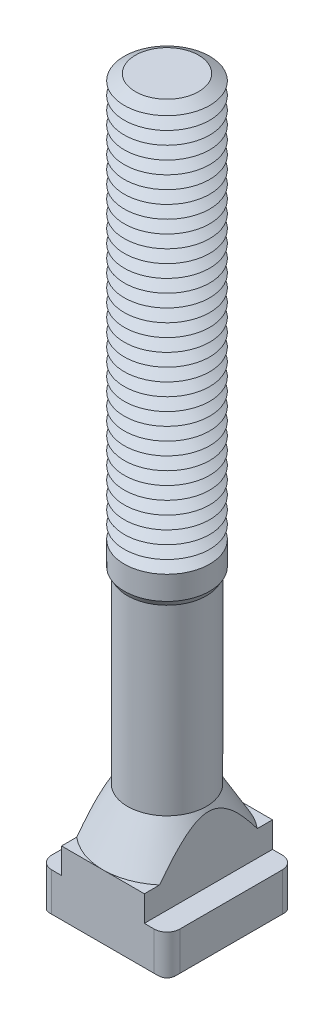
ISO-10303-21;
HEADER;
FILE_DESCRIPTION(('STEP AP214'),'2;1');
FILE_NAME('part.step','',(''),(''),'','','');
FILE_SCHEMA(('AUTOMOTIVE_DESIGN { 1 0 10303 214 1 1 1 1 }'));
ENDSEC;
DATA;
#1=APPLICATION_CONTEXT('core data for automotive mechanical design processes');
#2=APPLICATION_PROTOCOL_DEFINITION('international standard','automotive_design',2000,#1);
#3=PRODUCT_CONTEXT('',#1,'mechanical');
#4=PRODUCT('Part','Part','',(#3));
#5=PRODUCT_RELATED_PRODUCT_CATEGORY('part','',(#4));
#6=PRODUCT_DEFINITION_FORMATION('','',#4);
#7=PRODUCT_DEFINITION_CONTEXT('part definition',#1,'design');
#8=PRODUCT_DEFINITION('design','',#6,#7);
#9=PRODUCT_DEFINITION_SHAPE('','',#8);
#10=(LENGTH_UNIT() NAMED_UNIT(*) SI_UNIT(.MILLI.,.METRE.));
#11=(NAMED_UNIT(*) PLANE_ANGLE_UNIT() SI_UNIT($,.RADIAN.));
#12=(NAMED_UNIT(*) SI_UNIT($,.STERADIAN.) SOLID_ANGLE_UNIT());
#13=UNCERTAINTY_MEASURE_WITH_UNIT(LENGTH_MEASURE(1.E-05),#10,'distance_accuracy_value','');
#14=(GEOMETRIC_REPRESENTATION_CONTEXT(3) GLOBAL_UNCERTAINTY_ASSIGNED_CONTEXT((#13)) GLOBAL_UNIT_ASSIGNED_CONTEXT((#10,
#11,#12)) REPRESENTATION_CONTEXT('',''));
#15=CARTESIAN_POINT('',(0.,0.,0.));
#16=DIRECTION('',(0.,0.,1.));
#17=DIRECTION('',(1.,0.,0.));
#18=AXIS2_PLACEMENT_3D('',#15,#16,#17);
#19=CARTESIAN_POINT('',(0.,80.,0.));
#20=DIRECTION('',(0.,-1.,0.));
#21=DIRECTION('',(0.,0.,-1.));
#22=AXIS2_PLACEMENT_3D('',#19,#20,#21);
#23=CONICAL_SURFACE('',#22,3.70096189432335,1.0471975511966);
#24=CARTESIAN_POINT('',(0.,79.25,0.));
#25=DIRECTION('',(0.,-1.,0.));
#26=DIRECTION('',(0.,0.,-1.));
#27=AXIS2_PLACEMENT_3D('',#24,#25,#26);
#28=CIRCLE('',#27,5.00000000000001);
#29=CARTESIAN_POINT('',(0.,79.25,-5.00000000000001));
#30=VERTEX_POINT('',#29);
#31=EDGE_CURVE('E719',#30,#30,#28,.T.);
#32=ORIENTED_EDGE('',*,*,#31,.F.);
#33=EDGE_LOOP('',(#32));
#34=FACE_BOUND('',#33,.T.);
#35=CARTESIAN_POINT('',(0.,80.,0.));
#36=DIRECTION('',(0.,-1.,0.));
#37=DIRECTION('',(0.,0.,-1.));
#38=AXIS2_PLACEMENT_3D('',#35,#36,#37);
#39=CIRCLE('',#38,3.70096189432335);
#40=CARTESIAN_POINT('',(0.,80.,-3.70096189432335));
#41=VERTEX_POINT('',#40);
#42=EDGE_CURVE('E710',#41,#41,#39,.T.);
#43=ORIENTED_EDGE('',*,*,#42,.T.);
#44=EDGE_LOOP('',(#43));
#45=FACE_BOUND('',#44,.T.);
#46=ADVANCED_FACE('F39',(#34,#45),#23,.T.);
#47=CARTESIAN_POINT('',(0.,80.75,0.));
#48=DIRECTION('',(0.,1.,0.));
#49=DIRECTION('',(0.,0.,1.));
#50=AXIS2_PLACEMENT_3D('',#47,#48,#49);
#51=CONICAL_SURFACE('',#50,5.00000000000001,1.0471975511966);
#52=ORIENTED_EDGE('',*,*,#42,.F.);
#53=EDGE_LOOP('',(#52));
#54=FACE_BOUND('',#53,.T.);
#55=CARTESIAN_POINT('',(0.,80.75,0.));
#56=DIRECTION('',(0.,-1.,0.));
#57=DIRECTION('',(0.,0.,-1.));
#58=AXIS2_PLACEMENT_3D('',#55,#56,#57);
#59=CIRCLE('',#58,5.00000000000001);
#60=CARTESIAN_POINT('',(0.,80.75,-5.00000000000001));
#61=VERTEX_POINT('',#60);
#62=EDGE_CURVE('E707',#61,#61,#59,.T.);
#63=ORIENTED_EDGE('',*,*,#62,.T.);
#64=EDGE_LOOP('',(#63));
#65=FACE_BOUND('',#64,.T.);
#66=ADVANCED_FACE('F449',(#54,#65),#51,.T.);
#67=CARTESIAN_POINT('',(2.49948990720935,86.,0.));
#68=DIRECTION('',(0.,-1.,0.));
#69=DIRECTION('',(1.,0.,0.));
#70=AXIS2_PLACEMENT_3D('',#67,#68,#69);
#71=PLANE('',#70);
#72=CARTESIAN_POINT('',(0.,86.,0.));
#73=DIRECTION('',(0.,-1.,0.));
#74=DIRECTION('',(0.,0.,-1.));
#75=AXIS2_PLACEMENT_3D('',#72,#73,#74);
#76=CIRCLE('',#75,3.70096189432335);
#77=CARTESIAN_POINT('',(0.,86.,-3.70096189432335));
#78=VERTEX_POINT('',#77);
#79=EDGE_CURVE('E660',#78,#78,#76,.T.);
#80=ORIENTED_EDGE('',*,*,#79,.F.);
#81=EDGE_LOOP('',(#80));
#82=FACE_BOUND('',#81,.T.);
#83=ADVANCED_FACE('F455',(#82),#71,.F.);
#84=CARTESIAN_POINT('',(0.,86.,0.));
#85=DIRECTION('',(0.,-1.,0.));
#86=DIRECTION('',(0.,0.,-1.));
#87=AXIS2_PLACEMENT_3D('',#84,#85,#86);
#88=CONICAL_SURFACE('',#87,3.70096189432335,1.0471975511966);
#89=CARTESIAN_POINT('',(0.,85.25,0.));
#90=DIRECTION('',(0.,-1.,0.));
#91=DIRECTION('',(0.,0.,-1.));
#92=AXIS2_PLACEMENT_3D('',#89,#90,#91);
#93=CIRCLE('',#92,5.00000000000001);
#94=CARTESIAN_POINT('',(0.,85.25,-5.00000000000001));
#95=VERTEX_POINT('',#94);
#96=EDGE_CURVE('E657',#95,#95,#93,.T.);
#97=ORIENTED_EDGE('',*,*,#96,.F.);
#98=EDGE_LOOP('',(#97));
#99=FACE_BOUND('',#98,.T.);
#100=ORIENTED_EDGE('',*,*,#79,.T.);
#101=EDGE_LOOP('',(#100));
#102=FACE_BOUND('',#101,.T.);
#103=ADVANCED_FACE('F483',(#99,#102),#88,.T.);
#104=CARTESIAN_POINT('',(0.,85.25,0.));
#105=DIRECTION('',(0.,1.,0.));
#106=DIRECTION('',(0.,0.,1.));
#107=AXIS2_PLACEMENT_3D('',#104,#105,#106);
#108=CONICAL_SURFACE('',#107,5.00000000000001,1.0471975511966);
#109=CARTESIAN_POINT('',(0.,84.5,0.));
#110=DIRECTION('',(0.,-1.,0.));
#111=DIRECTION('',(0.,0.,-1.));
#112=AXIS2_PLACEMENT_3D('',#109,#110,#111);
#113=CIRCLE('',#112,3.70096189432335);
#114=CARTESIAN_POINT('',(0.,84.5,-3.70096189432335));
#115=VERTEX_POINT('',#114);
#116=EDGE_CURVE('E661',#115,#115,#113,.T.);
#117=ORIENTED_EDGE('',*,*,#116,.F.);
#118=EDGE_LOOP('',(#117));
#119=FACE_BOUND('',#118,.T.);
#120=ORIENTED_EDGE('',*,*,#96,.T.);
#121=EDGE_LOOP('',(#120));
#122=FACE_BOUND('',#121,.T.);
#123=ADVANCED_FACE('F480',(#119,#122),#108,.T.);
#124=CARTESIAN_POINT('',(0.,84.5,0.));
#125=DIRECTION('',(0.,-1.,0.));
#126=DIRECTION('',(0.,0.,-1.));
#127=AXIS2_PLACEMENT_3D('',#124,#125,#126);
#128=CONICAL_SURFACE('',#127,3.70096189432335,1.0471975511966);
#129=CARTESIAN_POINT('',(0.,83.75,0.));
#130=DIRECTION('',(0.,-1.,0.));
#131=DIRECTION('',(0.,0.,-1.));
#132=AXIS2_PLACEMENT_3D('',#129,#130,#131);
#133=CIRCLE('',#132,5.00000000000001);
#134=CARTESIAN_POINT('',(0.,83.75,-5.00000000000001));
#135=VERTEX_POINT('',#134);
#136=EDGE_CURVE('E730',#135,#135,#133,.T.);
#137=ORIENTED_EDGE('',*,*,#136,.F.);
#138=EDGE_LOOP('',(#137));
#139=FACE_BOUND('',#138,.T.);
#140=ORIENTED_EDGE('',*,*,#116,.T.);
#141=EDGE_LOOP('',(#140));
#142=FACE_BOUND('',#141,.T.);
#143=ADVANCED_FACE('F475',(#139,#142),#128,.T.);
#144=CARTESIAN_POINT('',(0.,83.75,0.));
#145=DIRECTION('',(0.,1.,0.));
#146=DIRECTION('',(0.,0.,1.));
#147=AXIS2_PLACEMENT_3D('',#144,#145,#146);
#148=CONICAL_SURFACE('',#147,5.00000000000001,1.0471975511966);
#149=CARTESIAN_POINT('',(0.,83.,0.));
#150=DIRECTION('',(0.,-1.,0.));
#151=DIRECTION('',(0.,0.,-1.));
#152=AXIS2_PLACEMENT_3D('',#149,#150,#151);
#153=CIRCLE('',#152,3.70096189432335);
#154=CARTESIAN_POINT('',(0.,83.,-3.70096189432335));
#155=VERTEX_POINT('',#154);
#156=EDGE_CURVE('E726',#155,#155,#153,.T.);
#157=ORIENTED_EDGE('',*,*,#156,.F.);
#158=EDGE_LOOP('',(#157));
#159=FACE_BOUND('',#158,.T.);
#160=ORIENTED_EDGE('',*,*,#136,.T.);
#161=EDGE_LOOP('',(#160));
#162=FACE_BOUND('',#161,.T.);
#163=ADVANCED_FACE('F472',(#159,#162),#148,.T.);
#164=CARTESIAN_POINT('',(0.,83.,0.));
#165=DIRECTION('',(0.,-1.,0.));
#166=DIRECTION('',(0.,0.,-1.));
#167=AXIS2_PLACEMENT_3D('',#164,#165,#166);
#168=CONICAL_SURFACE('',#167,3.70096189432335,1.0471975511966);
#169=CARTESIAN_POINT('',(0.,82.25,0.));
#170=DIRECTION('',(0.,-1.,0.));
#171=DIRECTION('',(0.,0.,-1.));
#172=AXIS2_PLACEMENT_3D('',#169,#170,#171);
#173=CIRCLE('',#172,5.00000000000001);
#174=CARTESIAN_POINT('',(0.,82.25,-5.00000000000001));
#175=VERTEX_POINT('',#174);
#176=EDGE_CURVE('E716',#175,#175,#173,.T.);
#177=ORIENTED_EDGE('',*,*,#176,.F.);
#178=EDGE_LOOP('',(#177));
#179=FACE_BOUND('',#178,.T.);
#180=ORIENTED_EDGE('',*,*,#156,.T.);
#181=EDGE_LOOP('',(#180));
#182=FACE_BOUND('',#181,.T.);
#183=ADVANCED_FACE('F466',(#179,#182),#168,.T.);
#184=CARTESIAN_POINT('',(0.,82.25,0.));
#185=DIRECTION('',(0.,1.,0.));
#186=DIRECTION('',(0.,0.,1.));
#187=AXIS2_PLACEMENT_3D('',#184,#185,#186);
#188=CONICAL_SURFACE('',#187,5.00000000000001,1.0471975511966);
#189=CARTESIAN_POINT('',(0.,81.5,0.));
#190=DIRECTION('',(0.,-1.,0.));
#191=DIRECTION('',(0.,0.,-1.));
#192=AXIS2_PLACEMENT_3D('',#189,#190,#191);
#193=CIRCLE('',#192,3.70096189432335);
#194=CARTESIAN_POINT('',(0.,81.5,-3.70096189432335));
#195=VERTEX_POINT('',#194);
#196=EDGE_CURVE('E709',#195,#195,#193,.T.);
#197=ORIENTED_EDGE('',*,*,#196,.F.);
#198=EDGE_LOOP('',(#197));
#199=FACE_BOUND('',#198,.T.);
#200=ORIENTED_EDGE('',*,*,#176,.T.);
#201=EDGE_LOOP('',(#200));
#202=FACE_BOUND('',#201,.T.);
#203=ADVANCED_FACE('F462',(#199,#202),#188,.T.);
#204=CARTESIAN_POINT('',(0.,81.5,0.));
#205=DIRECTION('',(0.,-1.,0.));
#206=DIRECTION('',(0.,0.,-1.));
#207=AXIS2_PLACEMENT_3D('',#204,#205,#206);
#208=CONICAL_SURFACE('',#207,3.70096189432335,1.0471975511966);
#209=ORIENTED_EDGE('',*,*,#62,.F.);
#210=EDGE_LOOP('',(#209));
#211=FACE_BOUND('',#210,.T.);
#212=ORIENTED_EDGE('',*,*,#196,.T.);
#213=EDGE_LOOP('',(#212));
#214=FACE_BOUND('',#213,.T.);
#215=ADVANCED_FACE('F465',(#211,#214),#208,.T.);
#216=CARTESIAN_POINT('',(0.,78.5,0.));
#217=DIRECTION('',(0.,-1.,0.));
#218=DIRECTION('',(0.,0.,-1.));
#219=AXIS2_PLACEMENT_3D('',#216,#217,#218);
#220=CONICAL_SURFACE('',#219,3.70096189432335,1.0471975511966);
#221=CARTESIAN_POINT('',(0.,77.75,0.));
#222=DIRECTION('',(0.,-1.,0.));
#223=DIRECTION('',(0.,0.,-1.));
#224=AXIS2_PLACEMENT_3D('',#221,#222,#223);
#225=CIRCLE('',#224,5.00000000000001);
#226=CARTESIAN_POINT('',(0.,77.75,-5.00000000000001));
#227=VERTEX_POINT('',#226);
#228=EDGE_CURVE('E805',#227,#227,#225,.T.);
#229=ORIENTED_EDGE('',*,*,#228,.F.);
#230=EDGE_LOOP('',(#229));
#231=FACE_BOUND('',#230,.T.);
#232=CARTESIAN_POINT('',(0.,78.5,0.));
#233=DIRECTION('',(0.,-1.,0.));
#234=DIRECTION('',(0.,0.,-1.));
#235=AXIS2_PLACEMENT_3D('',#232,#233,#234);
#236=CIRCLE('',#235,3.70096189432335);
#237=CARTESIAN_POINT('',(0.,78.5,-3.70096189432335));
#238=VERTEX_POINT('',#237);
#239=EDGE_CURVE('E809',#238,#238,#236,.T.);
#240=ORIENTED_EDGE('',*,*,#239,.T.);
#241=EDGE_LOOP('',(#240));
#242=FACE_BOUND('',#241,.T.);
#243=ADVANCED_FACE('F470',(#231,#242),#220,.T.);
#244=CARTESIAN_POINT('',(0.,79.25,0.));
#245=DIRECTION('',(0.,1.,0.));
#246=DIRECTION('',(0.,0.,1.));
#247=AXIS2_PLACEMENT_3D('',#244,#245,#246);
#248=CONICAL_SURFACE('',#247,5.00000000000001,1.0471975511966);
#249=ORIENTED_EDGE('',*,*,#239,.F.);
#250=EDGE_LOOP('',(#249));
#251=FACE_BOUND('',#250,.T.);
#252=ORIENTED_EDGE('',*,*,#31,.T.);
#253=EDGE_LOOP('',(#252));
#254=FACE_BOUND('',#253,.T.);
#255=ADVANCED_FACE('F815',(#251,#254),#248,.T.);
#256=CARTESIAN_POINT('',(0.,77.,0.));
#257=DIRECTION('',(0.,-1.,0.));
#258=DIRECTION('',(0.,0.,-1.));
#259=AXIS2_PLACEMENT_3D('',#256,#257,#258);
#260=CONICAL_SURFACE('',#259,3.70096189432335,1.0471975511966);
#261=CARTESIAN_POINT('',(0.,76.25,0.));
#262=DIRECTION('',(0.,-1.,0.));
#263=DIRECTION('',(0.,0.,-1.));
#264=AXIS2_PLACEMENT_3D('',#261,#262,#263);
#265=CIRCLE('',#264,5.00000000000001);
#266=CARTESIAN_POINT('',(0.,76.25,-5.00000000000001));
#267=VERTEX_POINT('',#266);
#268=EDGE_CURVE('E759',#267,#267,#265,.T.);
#269=ORIENTED_EDGE('',*,*,#268,.F.);
#270=EDGE_LOOP('',(#269));
#271=FACE_BOUND('',#270,.T.);
#272=CARTESIAN_POINT('',(0.,77.,0.));
#273=DIRECTION('',(0.,-1.,0.));
#274=DIRECTION('',(0.,0.,-1.));
#275=AXIS2_PLACEMENT_3D('',#272,#273,#274);
#276=CIRCLE('',#275,3.70096189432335);
#277=CARTESIAN_POINT('',(0.,77.,-3.70096189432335));
#278=VERTEX_POINT('',#277);
#279=EDGE_CURVE('E801',#278,#278,#276,.T.);
#280=ORIENTED_EDGE('',*,*,#279,.T.);
#281=EDGE_LOOP('',(#280));
#282=FACE_BOUND('',#281,.T.);
#283=ADVANCED_FACE('F817',(#271,#282),#260,.T.);
#284=CARTESIAN_POINT('',(0.,77.75,0.));
#285=DIRECTION('',(0.,1.,0.));
#286=DIRECTION('',(0.,0.,1.));
#287=AXIS2_PLACEMENT_3D('',#284,#285,#286);
#288=CONICAL_SURFACE('',#287,5.00000000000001,1.0471975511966);
#289=ORIENTED_EDGE('',*,*,#279,.F.);
#290=EDGE_LOOP('',(#289));
#291=FACE_BOUND('',#290,.T.);
#292=ORIENTED_EDGE('',*,*,#228,.T.);
#293=EDGE_LOOP('',(#292));
#294=FACE_BOUND('',#293,.T.);
#295=ADVANCED_FACE('F824',(#291,#294),#288,.T.);
#296=CARTESIAN_POINT('',(0.,75.5,0.));
#297=DIRECTION('',(0.,-1.,0.));
#298=DIRECTION('',(0.,0.,-1.));
#299=AXIS2_PLACEMENT_3D('',#296,#297,#298);
#300=CONICAL_SURFACE('',#299,3.70096189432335,1.0471975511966);
#301=CARTESIAN_POINT('',(0.,74.75,0.));
#302=DIRECTION('',(0.,-1.,0.));
#303=DIRECTION('',(0.,0.,-1.));
#304=AXIS2_PLACEMENT_3D('',#301,#302,#303);
#305=CIRCLE('',#304,5.00000000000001);
#306=CARTESIAN_POINT('',(0.,74.75,-5.00000000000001));
#307=VERTEX_POINT('',#306);
#308=EDGE_CURVE('E683',#307,#307,#305,.T.);
#309=ORIENTED_EDGE('',*,*,#308,.F.);
#310=EDGE_LOOP('',(#309));
#311=FACE_BOUND('',#310,.T.);
#312=CARTESIAN_POINT('',(0.,75.5,0.));
#313=DIRECTION('',(0.,-1.,0.));
#314=DIRECTION('',(0.,0.,-1.));
#315=AXIS2_PLACEMENT_3D('',#312,#313,#314);
#316=CIRCLE('',#315,3.70096189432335);
#317=CARTESIAN_POINT('',(0.,75.5,-3.70096189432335));
#318=VERTEX_POINT('',#317);
#319=EDGE_CURVE('E686',#318,#318,#316,.T.);
#320=ORIENTED_EDGE('',*,*,#319,.T.);
#321=EDGE_LOOP('',(#320));
#322=FACE_BOUND('',#321,.T.);
#323=ADVANCED_FACE('F832',(#311,#322),#300,.T.);
#324=CARTESIAN_POINT('',(0.,76.25,0.));
#325=DIRECTION('',(0.,1.,0.));
#326=DIRECTION('',(0.,0.,1.));
#327=AXIS2_PLACEMENT_3D('',#324,#325,#326);
#328=CONICAL_SURFACE('',#327,5.00000000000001,1.0471975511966);
#329=ORIENTED_EDGE('',*,*,#319,.F.);
#330=EDGE_LOOP('',(#329));
#331=FACE_BOUND('',#330,.T.);
#332=ORIENTED_EDGE('',*,*,#268,.T.);
#333=EDGE_LOOP('',(#332));
#334=FACE_BOUND('',#333,.T.);
#335=ADVANCED_FACE('F836',(#331,#334),#328,.T.);
#336=CARTESIAN_POINT('',(0.,74.,0.));
#337=DIRECTION('',(0.,-1.,0.));
#338=DIRECTION('',(0.,0.,-1.));
#339=AXIS2_PLACEMENT_3D('',#336,#337,#338);
#340=CONICAL_SURFACE('',#339,3.70096189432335,1.0471975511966);
#341=CARTESIAN_POINT('',(0.,73.25,0.));
#342=DIRECTION('',(0.,-1.,0.));
#343=DIRECTION('',(0.,0.,-1.));
#344=AXIS2_PLACEMENT_3D('',#341,#342,#343);
#345=CIRCLE('',#344,5.00000000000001);
#346=CARTESIAN_POINT('',(0.,73.25,-5.00000000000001));
#347=VERTEX_POINT('',#346);
#348=EDGE_CURVE('E704',#347,#347,#345,.T.);
#349=ORIENTED_EDGE('',*,*,#348,.F.);
#350=EDGE_LOOP('',(#349));
#351=FACE_BOUND('',#350,.T.);
#352=CARTESIAN_POINT('',(0.,74.,0.));
#353=DIRECTION('',(0.,-1.,0.));
#354=DIRECTION('',(0.,0.,-1.));
#355=AXIS2_PLACEMENT_3D('',#352,#353,#354);
#356=CIRCLE('',#355,3.70096189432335);
#357=CARTESIAN_POINT('',(0.,74.,-3.70096189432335));
#358=VERTEX_POINT('',#357);
#359=EDGE_CURVE('E687',#358,#358,#356,.T.);
#360=ORIENTED_EDGE('',*,*,#359,.T.);
#361=EDGE_LOOP('',(#360));
#362=FACE_BOUND('',#361,.T.);
#363=ADVANCED_FACE('F840',(#351,#362),#340,.T.);
#364=CARTESIAN_POINT('',(0.,74.75,0.));
#365=DIRECTION('',(0.,1.,0.));
#366=DIRECTION('',(0.,0.,1.));
#367=AXIS2_PLACEMENT_3D('',#364,#365,#366);
#368=CONICAL_SURFACE('',#367,5.00000000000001,1.0471975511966);
#369=ORIENTED_EDGE('',*,*,#359,.F.);
#370=EDGE_LOOP('',(#369));
#371=FACE_BOUND('',#370,.T.);
#372=ORIENTED_EDGE('',*,*,#308,.T.);
#373=EDGE_LOOP('',(#372));
#374=FACE_BOUND('',#373,.T.);
#375=ADVANCED_FACE('F844',(#371,#374),#368,.T.);
#376=CARTESIAN_POINT('',(0.,72.5,0.));
#377=DIRECTION('',(0.,-1.,0.));
#378=DIRECTION('',(0.,0.,-1.));
#379=AXIS2_PLACEMENT_3D('',#376,#377,#378);
#380=CONICAL_SURFACE('',#379,3.70096189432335,1.0471975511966);
#381=CARTESIAN_POINT('',(0.,71.75,0.));
#382=DIRECTION('',(0.,-1.,0.));
#383=DIRECTION('',(0.,0.,-1.));
#384=AXIS2_PLACEMENT_3D('',#381,#382,#383);
#385=CIRCLE('',#384,5.00000000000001);
#386=CARTESIAN_POINT('',(0.,71.75,-5.00000000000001));
#387=VERTEX_POINT('',#386);
#388=EDGE_CURVE('E705',#387,#387,#385,.T.);
#389=ORIENTED_EDGE('',*,*,#388,.F.);
#390=EDGE_LOOP('',(#389));
#391=FACE_BOUND('',#390,.T.);
#392=CARTESIAN_POINT('',(0.,72.5,0.));
#393=DIRECTION('',(0.,-1.,0.));
#394=DIRECTION('',(0.,0.,-1.));
#395=AXIS2_PLACEMENT_3D('',#392,#393,#394);
#396=CIRCLE('',#395,3.70096189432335);
#397=CARTESIAN_POINT('',(0.,72.5,-3.70096189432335));
#398=VERTEX_POINT('',#397);
#399=EDGE_CURVE('E701',#398,#398,#396,.T.);
#400=ORIENTED_EDGE('',*,*,#399,.T.);
#401=EDGE_LOOP('',(#400));
#402=FACE_BOUND('',#401,.T.);
#403=ADVANCED_FACE('F848',(#391,#402),#380,.T.);
#404=CARTESIAN_POINT('',(0.,73.25,0.));
#405=DIRECTION('',(0.,1.,0.));
#406=DIRECTION('',(0.,0.,1.));
#407=AXIS2_PLACEMENT_3D('',#404,#405,#406);
#408=CONICAL_SURFACE('',#407,5.00000000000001,1.0471975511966);
#409=ORIENTED_EDGE('',*,*,#399,.F.);
#410=EDGE_LOOP('',(#409));
#411=FACE_BOUND('',#410,.T.);
#412=ORIENTED_EDGE('',*,*,#348,.T.);
#413=EDGE_LOOP('',(#412));
#414=FACE_BOUND('',#413,.T.);
#415=ADVANCED_FACE('F852',(#411,#414),#408,.T.);
#416=CARTESIAN_POINT('',(0.,71.,0.));
#417=DIRECTION('',(0.,-1.,0.));
#418=DIRECTION('',(0.,0.,-1.));
#419=AXIS2_PLACEMENT_3D('',#416,#417,#418);
#420=CONICAL_SURFACE('',#419,3.70096189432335,1.0471975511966);
#421=CARTESIAN_POINT('',(0.,70.25,0.));
#422=DIRECTION('',(0.,-1.,0.));
#423=DIRECTION('',(0.,0.,-1.));
#424=AXIS2_PLACEMENT_3D('',#421,#422,#423);
#425=CIRCLE('',#424,5.00000000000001);
#426=CARTESIAN_POINT('',(0.,70.25,-5.00000000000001));
#427=VERTEX_POINT('',#426);
#428=EDGE_CURVE('E788',#427,#427,#425,.T.);
#429=ORIENTED_EDGE('',*,*,#428,.F.);
#430=EDGE_LOOP('',(#429));
#431=FACE_BOUND('',#430,.T.);
#432=CARTESIAN_POINT('',(0.,71.,0.));
#433=DIRECTION('',(0.,-1.,0.));
#434=DIRECTION('',(0.,0.,-1.));
#435=AXIS2_PLACEMENT_3D('',#432,#433,#434);
#436=CIRCLE('',#435,3.70096189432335);
#437=CARTESIAN_POINT('',(0.,71.,-3.70096189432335));
#438=VERTEX_POINT('',#437);
#439=EDGE_CURVE('E782',#438,#438,#436,.T.);
#440=ORIENTED_EDGE('',*,*,#439,.T.);
#441=EDGE_LOOP('',(#440));
#442=FACE_BOUND('',#441,.T.);
#443=ADVANCED_FACE('F856',(#431,#442),#420,.T.);
#444=CARTESIAN_POINT('',(0.,71.75,0.));
#445=DIRECTION('',(0.,1.,0.));
#446=DIRECTION('',(0.,0.,1.));
#447=AXIS2_PLACEMENT_3D('',#444,#445,#446);
#448=CONICAL_SURFACE('',#447,5.00000000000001,1.0471975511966);
#449=ORIENTED_EDGE('',*,*,#439,.F.);
#450=EDGE_LOOP('',(#449));
#451=FACE_BOUND('',#450,.T.);
#452=ORIENTED_EDGE('',*,*,#388,.T.);
#453=EDGE_LOOP('',(#452));
#454=FACE_BOUND('',#453,.T.);
#455=ADVANCED_FACE('F860',(#451,#454),#448,.T.);
#456=CARTESIAN_POINT('',(0.,69.5,0.));
#457=DIRECTION('',(0.,-1.,0.));
#458=DIRECTION('',(0.,0.,-1.));
#459=AXIS2_PLACEMENT_3D('',#456,#457,#458);
#460=CONICAL_SURFACE('',#459,3.70096189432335,1.0471975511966);
#461=CARTESIAN_POINT('',(0.,68.75,0.));
#462=DIRECTION('',(0.,-1.,0.));
#463=DIRECTION('',(0.,0.,-1.));
#464=AXIS2_PLACEMENT_3D('',#461,#462,#463);
#465=CIRCLE('',#464,5.00000000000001);
#466=CARTESIAN_POINT('',(0.,68.75,-5.00000000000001));
#467=VERTEX_POINT('',#466);
#468=EDGE_CURVE('E753',#467,#467,#465,.T.);
#469=ORIENTED_EDGE('',*,*,#468,.F.);
#470=EDGE_LOOP('',(#469));
#471=FACE_BOUND('',#470,.T.);
#472=CARTESIAN_POINT('',(0.,69.5,0.));
#473=DIRECTION('',(0.,-1.,0.));
#474=DIRECTION('',(0.,0.,-1.));
#475=AXIS2_PLACEMENT_3D('',#472,#473,#474);
#476=CIRCLE('',#475,3.70096189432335);
#477=CARTESIAN_POINT('',(0.,69.5,-3.70096189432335));
#478=VERTEX_POINT('',#477);
#479=EDGE_CURVE('E756',#478,#478,#476,.T.);
#480=ORIENTED_EDGE('',*,*,#479,.T.);
#481=EDGE_LOOP('',(#480));
#482=FACE_BOUND('',#481,.T.);
#483=ADVANCED_FACE('F864',(#471,#482),#460,.T.);
#484=CARTESIAN_POINT('',(0.,70.25,0.));
#485=DIRECTION('',(0.,1.,0.));
#486=DIRECTION('',(0.,0.,1.));
#487=AXIS2_PLACEMENT_3D('',#484,#485,#486);
#488=CONICAL_SURFACE('',#487,5.00000000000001,1.0471975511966);
#489=ORIENTED_EDGE('',*,*,#479,.F.);
#490=EDGE_LOOP('',(#489));
#491=FACE_BOUND('',#490,.T.);
#492=ORIENTED_EDGE('',*,*,#428,.T.);
#493=EDGE_LOOP('',(#492));
#494=FACE_BOUND('',#493,.T.);
#495=ADVANCED_FACE('F868',(#491,#494),#488,.T.);
#496=CARTESIAN_POINT('',(0.,68.,0.));
#497=DIRECTION('',(0.,-1.,0.));
#498=DIRECTION('',(0.,0.,-1.));
#499=AXIS2_PLACEMENT_3D('',#496,#497,#498);
#500=CONICAL_SURFACE('',#499,3.70096189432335,1.0471975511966);
#501=CARTESIAN_POINT('',(0.,67.25,0.));
#502=DIRECTION('',(0.,-1.,0.));
#503=DIRECTION('',(0.,0.,-1.));
#504=AXIS2_PLACEMENT_3D('',#501,#502,#503);
#505=CIRCLE('',#504,5.00000000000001);
#506=CARTESIAN_POINT('',(0.,67.25,-5.00000000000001));
#507=VERTEX_POINT('',#506);
#508=EDGE_CURVE('E680',#507,#507,#505,.T.);
#509=ORIENTED_EDGE('',*,*,#508,.F.);
#510=EDGE_LOOP('',(#509));
#511=FACE_BOUND('',#510,.T.);
#512=CARTESIAN_POINT('',(0.,68.,0.));
#513=DIRECTION('',(0.,-1.,0.));
#514=DIRECTION('',(0.,0.,-1.));
#515=AXIS2_PLACEMENT_3D('',#512,#513,#514);
#516=CIRCLE('',#515,3.70096189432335);
#517=CARTESIAN_POINT('',(0.,68.,-3.70096189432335));
#518=VERTEX_POINT('',#517);
#519=EDGE_CURVE('E699',#518,#518,#516,.T.);
#520=ORIENTED_EDGE('',*,*,#519,.T.);
#521=EDGE_LOOP('',(#520));
#522=FACE_BOUND('',#521,.T.);
#523=ADVANCED_FACE('F872',(#511,#522),#500,.T.);
#524=CARTESIAN_POINT('',(0.,68.75,0.));
#525=DIRECTION('',(0.,1.,0.));
#526=DIRECTION('',(0.,0.,1.));
#527=AXIS2_PLACEMENT_3D('',#524,#525,#526);
#528=CONICAL_SURFACE('',#527,5.00000000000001,1.0471975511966);
#529=ORIENTED_EDGE('',*,*,#519,.F.);
#530=EDGE_LOOP('',(#529));
#531=FACE_BOUND('',#530,.T.);
#532=ORIENTED_EDGE('',*,*,#468,.T.);
#533=EDGE_LOOP('',(#532));
#534=FACE_BOUND('',#533,.T.);
#535=ADVANCED_FACE('F876',(#531,#534),#528,.T.);
#536=CARTESIAN_POINT('',(0.,66.5,0.));
#537=DIRECTION('',(0.,-1.,0.));
#538=DIRECTION('',(0.,0.,-1.));
#539=AXIS2_PLACEMENT_3D('',#536,#537,#538);
#540=CONICAL_SURFACE('',#539,3.70096189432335,1.0471975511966);
#541=CARTESIAN_POINT('',(0.,65.75,0.));
#542=DIRECTION('',(0.,-1.,0.));
#543=DIRECTION('',(0.,0.,-1.));
#544=AXIS2_PLACEMENT_3D('',#541,#542,#543);
#545=CIRCLE('',#544,5.00000000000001);
#546=CARTESIAN_POINT('',(0.,65.75,-5.00000000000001));
#547=VERTEX_POINT('',#546);
#548=EDGE_CURVE('E681',#547,#547,#545,.T.);
#549=ORIENTED_EDGE('',*,*,#548,.F.);
#550=EDGE_LOOP('',(#549));
#551=FACE_BOUND('',#550,.T.);
#552=CARTESIAN_POINT('',(0.,66.5,0.));
#553=DIRECTION('',(0.,-1.,0.));
#554=DIRECTION('',(0.,0.,-1.));
#555=AXIS2_PLACEMENT_3D('',#552,#553,#554);
#556=CIRCLE('',#555,3.70096189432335);
#557=CARTESIAN_POINT('',(0.,66.5,-3.70096189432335));
#558=VERTEX_POINT('',#557);
#559=EDGE_CURVE('E677',#558,#558,#556,.T.);
#560=ORIENTED_EDGE('',*,*,#559,.T.);
#561=EDGE_LOOP('',(#560));
#562=FACE_BOUND('',#561,.T.);
#563=ADVANCED_FACE('F880',(#551,#562),#540,.T.);
#564=CARTESIAN_POINT('',(0.,67.25,0.));
#565=DIRECTION('',(0.,1.,0.));
#566=DIRECTION('',(0.,0.,1.));
#567=AXIS2_PLACEMENT_3D('',#564,#565,#566);
#568=CONICAL_SURFACE('',#567,5.00000000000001,1.0471975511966);
#569=ORIENTED_EDGE('',*,*,#559,.F.);
#570=EDGE_LOOP('',(#569));
#571=FACE_BOUND('',#570,.T.);
#572=ORIENTED_EDGE('',*,*,#508,.T.);
#573=EDGE_LOOP('',(#572));
#574=FACE_BOUND('',#573,.T.);
#575=ADVANCED_FACE('F884',(#571,#574),#568,.T.);
#576=CARTESIAN_POINT('',(0.,65.,0.));
#577=DIRECTION('',(0.,-1.,0.));
#578=DIRECTION('',(0.,0.,-1.));
#579=AXIS2_PLACEMENT_3D('',#576,#577,#578);
#580=CONICAL_SURFACE('',#579,3.70096189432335,1.0471975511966);
#581=CARTESIAN_POINT('',(0.,64.25,0.));
#582=DIRECTION('',(0.,-1.,0.));
#583=DIRECTION('',(0.,0.,-1.));
#584=AXIS2_PLACEMENT_3D('',#581,#582,#583);
#585=CIRCLE('',#584,5.00000000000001);
#586=CARTESIAN_POINT('',(0.,64.25,-5.00000000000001));
#587=VERTEX_POINT('',#586);
#588=EDGE_CURVE('E651',#587,#587,#585,.T.);
#589=ORIENTED_EDGE('',*,*,#588,.F.);
#590=EDGE_LOOP('',(#589));
#591=FACE_BOUND('',#590,.T.);
#592=CARTESIAN_POINT('',(0.,65.,0.));
#593=DIRECTION('',(0.,-1.,0.));
#594=DIRECTION('',(0.,0.,-1.));
#595=AXIS2_PLACEMENT_3D('',#592,#593,#594);
#596=CIRCLE('',#595,3.70096189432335);
#597=CARTESIAN_POINT('',(0.,65.,-3.70096189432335));
#598=VERTEX_POINT('',#597);
#599=EDGE_CURVE('E654',#598,#598,#596,.T.);
#600=ORIENTED_EDGE('',*,*,#599,.T.);
#601=EDGE_LOOP('',(#600));
#602=FACE_BOUND('',#601,.T.);
#603=ADVANCED_FACE('F888',(#591,#602),#580,.T.);
#604=CARTESIAN_POINT('',(0.,65.75,0.));
#605=DIRECTION('',(0.,1.,0.));
#606=DIRECTION('',(0.,0.,1.));
#607=AXIS2_PLACEMENT_3D('',#604,#605,#606);
#608=CONICAL_SURFACE('',#607,5.00000000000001,1.0471975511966);
#609=ORIENTED_EDGE('',*,*,#599,.F.);
#610=EDGE_LOOP('',(#609));
#611=FACE_BOUND('',#610,.T.);
#612=ORIENTED_EDGE('',*,*,#548,.T.);
#613=EDGE_LOOP('',(#612));
#614=FACE_BOUND('',#613,.T.);
#615=ADVANCED_FACE('F892',(#611,#614),#608,.T.);
#616=CARTESIAN_POINT('',(0.,63.5,0.));
#617=DIRECTION('',(0.,-1.,0.));
#618=DIRECTION('',(0.,0.,-1.));
#619=AXIS2_PLACEMENT_3D('',#616,#617,#618);
#620=CONICAL_SURFACE('',#619,3.70096189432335,1.0471975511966);
#621=CARTESIAN_POINT('',(0.,62.75,0.));
#622=DIRECTION('',(0.,-1.,0.));
#623=DIRECTION('',(0.,0.,-1.));
#624=AXIS2_PLACEMENT_3D('',#621,#622,#623);
#625=CIRCLE('',#624,5.00000000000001);
#626=CARTESIAN_POINT('',(0.,62.75,-5.00000000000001));
#627=VERTEX_POINT('',#626);
#628=EDGE_CURVE('E1103',#627,#627,#625,.T.);
#629=ORIENTED_EDGE('',*,*,#628,.F.);
#630=EDGE_LOOP('',(#629));
#631=FACE_BOUND('',#630,.T.);
#632=CARTESIAN_POINT('',(0.,63.5,0.));
#633=DIRECTION('',(0.,-1.,0.));
#634=DIRECTION('',(0.,0.,-1.));
#635=AXIS2_PLACEMENT_3D('',#632,#633,#634);
#636=CIRCLE('',#635,3.70096189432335);
#637=CARTESIAN_POINT('',(0.,63.5,-3.70096189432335));
#638=VERTEX_POINT('',#637);
#639=EDGE_CURVE('E655',#638,#638,#636,.T.);
#640=ORIENTED_EDGE('',*,*,#639,.T.);
#641=EDGE_LOOP('',(#640));
#642=FACE_BOUND('',#641,.T.);
#643=ADVANCED_FACE('F896',(#631,#642),#620,.T.);
#644=CARTESIAN_POINT('',(0.,64.25,0.));
#645=DIRECTION('',(0.,1.,0.));
#646=DIRECTION('',(0.,0.,1.));
#647=AXIS2_PLACEMENT_3D('',#644,#645,#646);
#648=CONICAL_SURFACE('',#647,5.00000000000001,1.0471975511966);
#649=ORIENTED_EDGE('',*,*,#639,.F.);
#650=EDGE_LOOP('',(#649));
#651=FACE_BOUND('',#650,.T.);
#652=ORIENTED_EDGE('',*,*,#588,.T.);
#653=EDGE_LOOP('',(#652));
#654=FACE_BOUND('',#653,.T.);
#655=ADVANCED_FACE('F900',(#651,#654),#648,.T.);
#656=CARTESIAN_POINT('',(0.,62.,0.));
#657=DIRECTION('',(0.,-1.,0.));
#658=DIRECTION('',(0.,0.,-1.));
#659=AXIS2_PLACEMENT_3D('',#656,#657,#658);
#660=CONICAL_SURFACE('',#659,3.70096189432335,1.0471975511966);
#661=CARTESIAN_POINT('',(0.,61.25,0.));
#662=DIRECTION('',(0.,-1.,0.));
#663=DIRECTION('',(0.,0.,-1.));
#664=AXIS2_PLACEMENT_3D('',#661,#662,#663);
#665=CIRCLE('',#664,5.00000000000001);
#666=CARTESIAN_POINT('',(0.,61.25,-5.00000000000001));
#667=VERTEX_POINT('',#666);
#668=EDGE_CURVE('E648',#667,#667,#665,.T.);
#669=ORIENTED_EDGE('',*,*,#668,.F.);
#670=EDGE_LOOP('',(#669));
#671=FACE_BOUND('',#670,.T.);
#672=CARTESIAN_POINT('',(0.,62.,0.));
#673=DIRECTION('',(0.,-1.,0.));
#674=DIRECTION('',(0.,0.,-1.));
#675=AXIS2_PLACEMENT_3D('',#672,#673,#674);
#676=CIRCLE('',#675,3.70096189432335);
#677=CARTESIAN_POINT('',(0.,62.,-3.70096189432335));
#678=VERTEX_POINT('',#677);
#679=EDGE_CURVE('E769',#678,#678,#676,.T.);
#680=ORIENTED_EDGE('',*,*,#679,.T.);
#681=EDGE_LOOP('',(#680));
#682=FACE_BOUND('',#681,.T.);
#683=ADVANCED_FACE('F904',(#671,#682),#660,.T.);
#684=CARTESIAN_POINT('',(0.,62.75,0.));
#685=DIRECTION('',(0.,1.,0.));
#686=DIRECTION('',(0.,0.,1.));
#687=AXIS2_PLACEMENT_3D('',#684,#685,#686);
#688=CONICAL_SURFACE('',#687,5.00000000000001,1.0471975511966);
#689=ORIENTED_EDGE('',*,*,#679,.F.);
#690=EDGE_LOOP('',(#689));
#691=FACE_BOUND('',#690,.T.);
#692=ORIENTED_EDGE('',*,*,#628,.T.);
#693=EDGE_LOOP('',(#692));
#694=FACE_BOUND('',#693,.T.);
#695=ADVANCED_FACE('F908',(#691,#694),#688,.T.);
#696=CARTESIAN_POINT('',(0.,60.5,0.));
#697=DIRECTION('',(0.,-1.,0.));
#698=DIRECTION('',(0.,0.,-1.));
#699=AXIS2_PLACEMENT_3D('',#696,#697,#698);
#700=CONICAL_SURFACE('',#699,3.70096189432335,1.0471975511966);
#701=CARTESIAN_POINT('',(0.,59.75,0.));
#702=DIRECTION('',(0.,-1.,0.));
#703=DIRECTION('',(0.,0.,-1.));
#704=AXIS2_PLACEMENT_3D('',#701,#702,#703);
#705=CIRCLE('',#704,5.00000000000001);
#706=CARTESIAN_POINT('',(0.,59.75,-5.00000000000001));
#707=VERTEX_POINT('',#706);
#708=EDGE_CURVE('E649',#707,#707,#705,.T.);
#709=ORIENTED_EDGE('',*,*,#708,.F.);
#710=EDGE_LOOP('',(#709));
#711=FACE_BOUND('',#710,.T.);
#712=CARTESIAN_POINT('',(0.,60.5,0.));
#713=DIRECTION('',(0.,-1.,0.));
#714=DIRECTION('',(0.,0.,-1.));
#715=AXIS2_PLACEMENT_3D('',#712,#713,#714);
#716=CIRCLE('',#715,3.70096189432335);
#717=CARTESIAN_POINT('',(0.,60.5,-3.70096189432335));
#718=VERTEX_POINT('',#717);
#719=EDGE_CURVE('E645',#718,#718,#716,.T.);
#720=ORIENTED_EDGE('',*,*,#719,.T.);
#721=EDGE_LOOP('',(#720));
#722=FACE_BOUND('',#721,.T.);
#723=ADVANCED_FACE('F912',(#711,#722),#700,.T.);
#724=CARTESIAN_POINT('',(0.,61.25,0.));
#725=DIRECTION('',(0.,1.,0.));
#726=DIRECTION('',(0.,0.,1.));
#727=AXIS2_PLACEMENT_3D('',#724,#725,#726);
#728=CONICAL_SURFACE('',#727,5.00000000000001,1.0471975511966);
#729=ORIENTED_EDGE('',*,*,#719,.F.);
#730=EDGE_LOOP('',(#729));
#731=FACE_BOUND('',#730,.T.);
#732=ORIENTED_EDGE('',*,*,#668,.T.);
#733=EDGE_LOOP('',(#732));
#734=FACE_BOUND('',#733,.T.);
#735=ADVANCED_FACE('F916',(#731,#734),#728,.T.);
#736=CARTESIAN_POINT('',(0.,59.,0.));
#737=DIRECTION('',(0.,-1.,0.));
#738=DIRECTION('',(0.,0.,-1.));
#739=AXIS2_PLACEMENT_3D('',#736,#737,#738);
#740=CONICAL_SURFACE('',#739,3.70096189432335,1.0471975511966);
#741=CARTESIAN_POINT('',(0.,58.25,0.));
#742=DIRECTION('',(0.,-1.,0.));
#743=DIRECTION('',(0.,0.,-1.));
#744=AXIS2_PLACEMENT_3D('',#741,#742,#743);
#745=CIRCLE('',#744,5.00000000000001);
#746=CARTESIAN_POINT('',(0.,58.25,-5.00000000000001));
#747=VERTEX_POINT('',#746);
#748=EDGE_CURVE('E675',#747,#747,#745,.T.);
#749=ORIENTED_EDGE('',*,*,#748,.F.);
#750=EDGE_LOOP('',(#749));
#751=FACE_BOUND('',#750,.T.);
#752=CARTESIAN_POINT('',(0.,59.,0.));
#753=DIRECTION('',(0.,-1.,0.));
#754=DIRECTION('',(0.,0.,-1.));
#755=AXIS2_PLACEMENT_3D('',#752,#753,#754);
#756=CIRCLE('',#755,3.70096189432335);
#757=CARTESIAN_POINT('',(0.,59.,-3.70096189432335));
#758=VERTEX_POINT('',#757);
#759=EDGE_CURVE('E672',#758,#758,#756,.T.);
#760=ORIENTED_EDGE('',*,*,#759,.T.);
#761=EDGE_LOOP('',(#760));
#762=FACE_BOUND('',#761,.T.);
#763=ADVANCED_FACE('F920',(#751,#762),#740,.T.);
#764=CARTESIAN_POINT('',(0.,59.75,0.));
#765=DIRECTION('',(0.,1.,0.));
#766=DIRECTION('',(0.,0.,1.));
#767=AXIS2_PLACEMENT_3D('',#764,#765,#766);
#768=CONICAL_SURFACE('',#767,5.00000000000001,1.0471975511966);
#769=ORIENTED_EDGE('',*,*,#759,.F.);
#770=EDGE_LOOP('',(#769));
#771=FACE_BOUND('',#770,.T.);
#772=ORIENTED_EDGE('',*,*,#708,.T.);
#773=EDGE_LOOP('',(#772));
#774=FACE_BOUND('',#773,.T.);
#775=ADVANCED_FACE('F924',(#771,#774),#768,.T.);
#776=CARTESIAN_POINT('',(0.,57.5,0.));
#777=DIRECTION('',(0.,-1.,0.));
#778=DIRECTION('',(0.,0.,-1.));
#779=AXIS2_PLACEMENT_3D('',#776,#777,#778);
#780=CONICAL_SURFACE('',#779,3.70096189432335,1.0471975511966);
#781=CARTESIAN_POINT('',(0.,56.75,0.));
#782=DIRECTION('',(0.,-1.,0.));
#783=DIRECTION('',(0.,0.,-1.));
#784=AXIS2_PLACEMENT_3D('',#781,#782,#783);
#785=CIRCLE('',#784,5.00000000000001);
#786=CARTESIAN_POINT('',(0.,56.75,-5.00000000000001));
#787=VERTEX_POINT('',#786);
#788=EDGE_CURVE('E750',#787,#787,#785,.T.);
#789=ORIENTED_EDGE('',*,*,#788,.F.);
#790=EDGE_LOOP('',(#789));
#791=FACE_BOUND('',#790,.T.);
#792=CARTESIAN_POINT('',(0.,57.5,0.));
#793=DIRECTION('',(0.,-1.,0.));
#794=DIRECTION('',(0.,0.,-1.));
#795=AXIS2_PLACEMENT_3D('',#792,#793,#794);
#796=CIRCLE('',#795,3.70096189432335);
#797=CARTESIAN_POINT('',(0.,57.5,-3.70096189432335));
#798=VERTEX_POINT('',#797);
#799=EDGE_CURVE('E1090',#798,#798,#796,.T.);
#800=ORIENTED_EDGE('',*,*,#799,.T.);
#801=EDGE_LOOP('',(#800));
#802=FACE_BOUND('',#801,.T.);
#803=ADVANCED_FACE('F928',(#791,#802),#780,.T.);
#804=CARTESIAN_POINT('',(0.,58.25,0.));
#805=DIRECTION('',(0.,1.,0.));
#806=DIRECTION('',(0.,0.,1.));
#807=AXIS2_PLACEMENT_3D('',#804,#805,#806);
#808=CONICAL_SURFACE('',#807,5.00000000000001,1.0471975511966);
#809=ORIENTED_EDGE('',*,*,#799,.F.);
#810=EDGE_LOOP('',(#809));
#811=FACE_BOUND('',#810,.T.);
#812=ORIENTED_EDGE('',*,*,#748,.T.);
#813=EDGE_LOOP('',(#812));
#814=FACE_BOUND('',#813,.T.);
#815=ADVANCED_FACE('F932',(#811,#814),#808,.T.);
#816=CARTESIAN_POINT('',(0.,56.,0.));
#817=DIRECTION('',(0.,-1.,0.));
#818=DIRECTION('',(0.,0.,-1.));
#819=AXIS2_PLACEMENT_3D('',#816,#817,#818);
#820=CONICAL_SURFACE('',#819,3.70096189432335,1.0471975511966);
#821=CARTESIAN_POINT('',(0.,55.25,0.));
#822=DIRECTION('',(0.,-1.,0.));
#823=DIRECTION('',(0.,0.,-1.));
#824=AXIS2_PLACEMENT_3D('',#821,#822,#823);
#825=CIRCLE('',#824,5.00000000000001);
#826=CARTESIAN_POINT('',(0.,55.25,-5.00000000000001));
#827=VERTEX_POINT('',#826);
#828=EDGE_CURVE('E751',#827,#827,#825,.T.);
#829=ORIENTED_EDGE('',*,*,#828,.F.);
#830=EDGE_LOOP('',(#829));
#831=FACE_BOUND('',#830,.T.);
#832=CARTESIAN_POINT('',(0.,56.,0.));
#833=DIRECTION('',(0.,-1.,0.));
#834=DIRECTION('',(0.,0.,-1.));
#835=AXIS2_PLACEMENT_3D('',#832,#833,#834);
#836=CIRCLE('',#835,3.70096189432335);
#837=CARTESIAN_POINT('',(0.,56.,-3.70096189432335));
#838=VERTEX_POINT('',#837);
#839=EDGE_CURVE('E747',#838,#838,#836,.T.);
#840=ORIENTED_EDGE('',*,*,#839,.T.);
#841=EDGE_LOOP('',(#840));
#842=FACE_BOUND('',#841,.T.);
#843=ADVANCED_FACE('F936',(#831,#842),#820,.T.);
#844=CARTESIAN_POINT('',(0.,56.75,0.));
#845=DIRECTION('',(0.,1.,0.));
#846=DIRECTION('',(0.,0.,1.));
#847=AXIS2_PLACEMENT_3D('',#844,#845,#846);
#848=CONICAL_SURFACE('',#847,5.00000000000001,1.0471975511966);
#849=ORIENTED_EDGE('',*,*,#839,.F.);
#850=EDGE_LOOP('',(#849));
#851=FACE_BOUND('',#850,.T.);
#852=ORIENTED_EDGE('',*,*,#788,.T.);
#853=EDGE_LOOP('',(#852));
#854=FACE_BOUND('',#853,.T.);
#855=ADVANCED_FACE('F940',(#851,#854),#848,.T.);
#856=CARTESIAN_POINT('',(0.,54.5,0.));
#857=DIRECTION('',(0.,-1.,0.));
#858=DIRECTION('',(0.,0.,-1.));
#859=AXIS2_PLACEMENT_3D('',#856,#857,#858);
#860=CONICAL_SURFACE('',#859,3.70096189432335,1.0471975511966);
#861=CARTESIAN_POINT('',(0.,53.75,0.));
#862=DIRECTION('',(0.,-1.,0.));
#863=DIRECTION('',(0.,0.,-1.));
#864=AXIS2_PLACEMENT_3D('',#861,#862,#863);
#865=CIRCLE('',#864,5.00000000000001);
#866=CARTESIAN_POINT('',(0.,53.75,-5.00000000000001));
#867=VERTEX_POINT('',#866);
#868=EDGE_CURVE('E691',#867,#867,#865,.T.);
#869=ORIENTED_EDGE('',*,*,#868,.F.);
#870=EDGE_LOOP('',(#869));
#871=FACE_BOUND('',#870,.T.);
#872=CARTESIAN_POINT('',(0.,54.5,0.));
#873=DIRECTION('',(0.,-1.,0.));
#874=DIRECTION('',(0.,0.,-1.));
#875=AXIS2_PLACEMENT_3D('',#872,#873,#874);
#876=CIRCLE('',#875,3.70096189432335);
#877=CARTESIAN_POINT('',(0.,54.5,-3.70096189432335));
#878=VERTEX_POINT('',#877);
#879=EDGE_CURVE('E694',#878,#878,#876,.T.);
#880=ORIENTED_EDGE('',*,*,#879,.T.);
#881=EDGE_LOOP('',(#880));
#882=FACE_BOUND('',#881,.T.);
#883=ADVANCED_FACE('F944',(#871,#882),#860,.T.);
#884=CARTESIAN_POINT('',(0.,55.25,0.));
#885=DIRECTION('',(0.,1.,0.));
#886=DIRECTION('',(0.,0.,1.));
#887=AXIS2_PLACEMENT_3D('',#884,#885,#886);
#888=CONICAL_SURFACE('',#887,5.00000000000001,1.0471975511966);
#889=ORIENTED_EDGE('',*,*,#879,.F.);
#890=EDGE_LOOP('',(#889));
#891=FACE_BOUND('',#890,.T.);
#892=ORIENTED_EDGE('',*,*,#828,.T.);
#893=EDGE_LOOP('',(#892));
#894=FACE_BOUND('',#893,.T.);
#895=ADVANCED_FACE('F948',(#891,#894),#888,.T.);
#896=CARTESIAN_POINT('',(0.,53.,0.));
#897=DIRECTION('',(0.,-1.,0.));
#898=DIRECTION('',(0.,0.,-1.));
#899=AXIS2_PLACEMENT_3D('',#896,#897,#898);
#900=CONICAL_SURFACE('',#899,3.70096189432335,1.0471975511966);
#901=CARTESIAN_POINT('',(0.,52.25,0.));
#902=DIRECTION('',(0.,-1.,0.));
#903=DIRECTION('',(0.,0.,-1.));
#904=AXIS2_PLACEMENT_3D('',#901,#902,#903);
#905=CIRCLE('',#904,5.00000000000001);
#906=CARTESIAN_POINT('',(0.,52.25,-5.00000000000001));
#907=VERTEX_POINT('',#906);
#908=EDGE_CURVE('E1077',#907,#907,#905,.T.);
#909=ORIENTED_EDGE('',*,*,#908,.F.);
#910=EDGE_LOOP('',(#909));
#911=FACE_BOUND('',#910,.T.);
#912=CARTESIAN_POINT('',(0.,53.,0.));
#913=DIRECTION('',(0.,-1.,0.));
#914=DIRECTION('',(0.,0.,-1.));
#915=AXIS2_PLACEMENT_3D('',#912,#913,#914);
#916=CIRCLE('',#915,3.70096189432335);
#917=CARTESIAN_POINT('',(0.,53.,-3.70096189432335));
#918=VERTEX_POINT('',#917);
#919=EDGE_CURVE('E695',#918,#918,#916,.T.);
#920=ORIENTED_EDGE('',*,*,#919,.T.);
#921=EDGE_LOOP('',(#920));
#922=FACE_BOUND('',#921,.T.);
#923=ADVANCED_FACE('F952',(#911,#922),#900,.T.);
#924=CARTESIAN_POINT('',(0.,53.75,0.));
#925=DIRECTION('',(0.,1.,0.));
#926=DIRECTION('',(0.,0.,1.));
#927=AXIS2_PLACEMENT_3D('',#924,#925,#926);
#928=CONICAL_SURFACE('',#927,5.00000000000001,1.0471975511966);
#929=ORIENTED_EDGE('',*,*,#919,.F.);
#930=EDGE_LOOP('',(#929));
#931=FACE_BOUND('',#930,.T.);
#932=ORIENTED_EDGE('',*,*,#868,.T.);
#933=EDGE_LOOP('',(#932));
#934=FACE_BOUND('',#933,.T.);
#935=ADVANCED_FACE('F956',(#931,#934),#928,.T.);
#936=CARTESIAN_POINT('',(0.,51.5,0.));
#937=DIRECTION('',(0.,-1.,0.));
#938=DIRECTION('',(0.,0.,-1.));
#939=AXIS2_PLACEMENT_3D('',#936,#937,#938);
#940=CONICAL_SURFACE('',#939,3.70096189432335,1.0471975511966);
#941=CARTESIAN_POINT('',(0.,50.75,0.));
#942=DIRECTION('',(0.,-1.,0.));
#943=DIRECTION('',(0.,0.,-1.));
#944=AXIS2_PLACEMENT_3D('',#941,#942,#943);
#945=CIRCLE('',#944,5.00000000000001);
#946=CARTESIAN_POINT('',(0.,50.75,-5.00000000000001));
#947=VERTEX_POINT('',#946);
#948=EDGE_CURVE('E639',#947,#947,#945,.T.);
#949=ORIENTED_EDGE('',*,*,#948,.F.);
#950=EDGE_LOOP('',(#949));
#951=FACE_BOUND('',#950,.T.);
#952=CARTESIAN_POINT('',(0.,51.5,0.));
#953=DIRECTION('',(0.,-1.,0.));
#954=DIRECTION('',(0.,0.,-1.));
#955=AXIS2_PLACEMENT_3D('',#952,#953,#954);
#956=CIRCLE('',#955,3.70096189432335);
#957=CARTESIAN_POINT('',(0.,51.5,-3.70096189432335));
#958=VERTEX_POINT('',#957);
#959=EDGE_CURVE('E642',#958,#958,#956,.T.);
#960=ORIENTED_EDGE('',*,*,#959,.T.);
#961=EDGE_LOOP('',(#960));
#962=FACE_BOUND('',#961,.T.);
#963=ADVANCED_FACE('F960',(#951,#962),#940,.T.);
#964=CARTESIAN_POINT('',(0.,52.25,0.));
#965=DIRECTION('',(0.,1.,0.));
#966=DIRECTION('',(0.,0.,1.));
#967=AXIS2_PLACEMENT_3D('',#964,#965,#966);
#968=CONICAL_SURFACE('',#967,5.00000000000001,1.0471975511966);
#969=ORIENTED_EDGE('',*,*,#959,.F.);
#970=EDGE_LOOP('',(#969));
#971=FACE_BOUND('',#970,.T.);
#972=ORIENTED_EDGE('',*,*,#908,.T.);
#973=EDGE_LOOP('',(#972));
#974=FACE_BOUND('',#973,.T.);
#975=ADVANCED_FACE('F964',(#971,#974),#968,.T.);
#976=CARTESIAN_POINT('',(0.,50.,0.));
#977=DIRECTION('',(0.,-1.,0.));
#978=DIRECTION('',(0.,0.,-1.));
#979=AXIS2_PLACEMENT_3D('',#976,#977,#978);
#980=CONICAL_SURFACE('',#979,3.70096189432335,1.0471975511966);
#981=CARTESIAN_POINT('',(0.,49.25,0.));
#982=DIRECTION('',(0.,-1.,0.));
#983=DIRECTION('',(0.,0.,-1.));
#984=AXIS2_PLACEMENT_3D('',#981,#982,#983);
#985=CIRCLE('',#984,5.00000000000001);
#986=CARTESIAN_POINT('',(0.,49.25,-5.00000000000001));
#987=VERTEX_POINT('',#986);
#988=EDGE_CURVE('E1067',#987,#987,#985,.T.);
#989=ORIENTED_EDGE('',*,*,#988,.F.);
#990=EDGE_LOOP('',(#989));
#991=FACE_BOUND('',#990,.T.);
#992=CARTESIAN_POINT('',(0.,50.,0.));
#993=DIRECTION('',(0.,-1.,0.));
#994=DIRECTION('',(0.,0.,-1.));
#995=AXIS2_PLACEMENT_3D('',#992,#993,#994);
#996=CIRCLE('',#995,3.70096189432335);
#997=CARTESIAN_POINT('',(0.,50.,-3.70096189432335));
#998=VERTEX_POINT('',#997);
#999=EDGE_CURVE('E643',#998,#998,#996,.T.);
#1000=ORIENTED_EDGE('',*,*,#999,.T.);
#1001=EDGE_LOOP('',(#1000));
#1002=FACE_BOUND('',#1001,.T.);
#1003=ADVANCED_FACE('F968',(#991,#1002),#980,.T.);
#1004=CARTESIAN_POINT('',(0.,50.75,0.));
#1005=DIRECTION('',(0.,1.,0.));
#1006=DIRECTION('',(0.,0.,1.));
#1007=AXIS2_PLACEMENT_3D('',#1004,#1005,#1006);
#1008=CONICAL_SURFACE('',#1007,5.00000000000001,1.0471975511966);
#1009=ORIENTED_EDGE('',*,*,#999,.F.);
#1010=EDGE_LOOP('',(#1009));
#1011=FACE_BOUND('',#1010,.T.);
#1012=ORIENTED_EDGE('',*,*,#948,.T.);
#1013=EDGE_LOOP('',(#1012));
#1014=FACE_BOUND('',#1013,.T.);
#1015=ADVANCED_FACE('F972',(#1011,#1014),#1008,.T.);
#1016=CARTESIAN_POINT('',(0.,48.5,0.));
#1017=DIRECTION('',(0.,-1.,0.));
#1018=DIRECTION('',(0.,0.,-1.));
#1019=AXIS2_PLACEMENT_3D('',#1016,#1017,#1018);
#1020=CONICAL_SURFACE('',#1019,3.70096189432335,1.0471975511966);
#1021=CARTESIAN_POINT('',(0.,47.75,0.));
#1022=DIRECTION('',(0.,-1.,0.));
#1023=DIRECTION('',(0.,0.,-1.));
#1024=AXIS2_PLACEMENT_3D('',#1021,#1022,#1023);
#1025=CIRCLE('',#1024,5.00000000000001);
#1026=CARTESIAN_POINT('',(0.,47.75,-5.00000000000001));
#1027=VERTEX_POINT('',#1026);
#1028=EDGE_CURVE('E762',#1027,#1027,#1025,.T.);
#1029=ORIENTED_EDGE('',*,*,#1028,.F.);
#1030=EDGE_LOOP('',(#1029));
#1031=FACE_BOUND('',#1030,.T.);
#1032=CARTESIAN_POINT('',(0.,48.5,0.));
#1033=DIRECTION('',(0.,-1.,0.));
#1034=DIRECTION('',(0.,0.,-1.));
#1035=AXIS2_PLACEMENT_3D('',#1032,#1033,#1034);
#1036=CIRCLE('',#1035,3.70096189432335);
#1037=CARTESIAN_POINT('',(0.,48.5,-3.70096189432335));
#1038=VERTEX_POINT('',#1037);
#1039=EDGE_CURVE('E765',#1038,#1038,#1036,.T.);
#1040=ORIENTED_EDGE('',*,*,#1039,.T.);
#1041=EDGE_LOOP('',(#1040));
#1042=FACE_BOUND('',#1041,.T.);
#1043=ADVANCED_FACE('F976',(#1031,#1042),#1020,.T.);
#1044=CARTESIAN_POINT('',(0.,49.25,0.));
#1045=DIRECTION('',(0.,1.,0.));
#1046=DIRECTION('',(0.,0.,1.));
#1047=AXIS2_PLACEMENT_3D('',#1044,#1045,#1046);
#1048=CONICAL_SURFACE('',#1047,5.00000000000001,1.0471975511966);
#1049=ORIENTED_EDGE('',*,*,#1039,.F.);
#1050=EDGE_LOOP('',(#1049));
#1051=FACE_BOUND('',#1050,.T.);
#1052=ORIENTED_EDGE('',*,*,#988,.T.);
#1053=EDGE_LOOP('',(#1052));
#1054=FACE_BOUND('',#1053,.T.);
#1055=ADVANCED_FACE('F980',(#1051,#1054),#1048,.T.);
#1056=CARTESIAN_POINT('',(0.,47.,0.));
#1057=DIRECTION('',(0.,-1.,0.));
#1058=DIRECTION('',(0.,0.,-1.));
#1059=AXIS2_PLACEMENT_3D('',#1056,#1057,#1058);
#1060=CONICAL_SURFACE('',#1059,3.70096189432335,1.0471975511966);
#1061=CARTESIAN_POINT('',(0.,46.25,0.));
#1062=DIRECTION('',(0.,-1.,0.));
#1063=DIRECTION('',(0.,0.,-1.));
#1064=AXIS2_PLACEMENT_3D('',#1061,#1062,#1063);
#1065=CIRCLE('',#1064,5.00000000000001);
#1066=CARTESIAN_POINT('',(0.,46.25,-5.00000000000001));
#1067=VERTEX_POINT('',#1066);
#1068=EDGE_CURVE('E1057',#1067,#1067,#1065,.T.);
#1069=ORIENTED_EDGE('',*,*,#1068,.F.);
#1070=EDGE_LOOP('',(#1069));
#1071=FACE_BOUND('',#1070,.T.);
#1072=CARTESIAN_POINT('',(0.,47.,0.));
#1073=DIRECTION('',(0.,-1.,0.));
#1074=DIRECTION('',(0.,0.,-1.));
#1075=AXIS2_PLACEMENT_3D('',#1072,#1073,#1074);
#1076=CIRCLE('',#1075,3.70096189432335);
#1077=CARTESIAN_POINT('',(0.,47.,-3.70096189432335));
#1078=VERTEX_POINT('',#1077);
#1079=EDGE_CURVE('E766',#1078,#1078,#1076,.T.);
#1080=ORIENTED_EDGE('',*,*,#1079,.T.);
#1081=EDGE_LOOP('',(#1080));
#1082=FACE_BOUND('',#1081,.T.);
#1083=ADVANCED_FACE('F984',(#1071,#1082),#1060,.T.);
#1084=CARTESIAN_POINT('',(0.,47.75,0.));
#1085=DIRECTION('',(0.,1.,0.));
#1086=DIRECTION('',(0.,0.,1.));
#1087=AXIS2_PLACEMENT_3D('',#1084,#1085,#1086);
#1088=CONICAL_SURFACE('',#1087,5.00000000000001,1.0471975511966);
#1089=ORIENTED_EDGE('',*,*,#1079,.F.);
#1090=EDGE_LOOP('',(#1089));
#1091=FACE_BOUND('',#1090,.T.);
#1092=ORIENTED_EDGE('',*,*,#1028,.T.);
#1093=EDGE_LOOP('',(#1092));
#1094=FACE_BOUND('',#1093,.T.);
#1095=ADVANCED_FACE('F988',(#1091,#1094),#1088,.T.);
#1096=CARTESIAN_POINT('',(0.,45.5,0.));
#1097=DIRECTION('',(0.,-1.,0.));
#1098=DIRECTION('',(0.,0.,-1.));
#1099=AXIS2_PLACEMENT_3D('',#1096,#1097,#1098);
#1100=CONICAL_SURFACE('',#1099,3.70096189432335,1.0471975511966);
#1101=CARTESIAN_POINT('',(0.,44.75,0.));
#1102=DIRECTION('',(0.,-1.,0.));
#1103=DIRECTION('',(0.,0.,-1.));
#1104=AXIS2_PLACEMENT_3D('',#1101,#1102,#1103);
#1105=CIRCLE('',#1104,5.00000000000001);
#1106=CARTESIAN_POINT('',(0.,44.75,-5.00000000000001));
#1107=VERTEX_POINT('',#1106);
#1108=EDGE_CURVE('E1049',#1107,#1107,#1105,.T.);
#1109=ORIENTED_EDGE('',*,*,#1108,.F.);
#1110=EDGE_LOOP('',(#1109));
#1111=FACE_BOUND('',#1110,.T.);
#1112=CARTESIAN_POINT('',(0.,45.5,0.));
#1113=DIRECTION('',(0.,-1.,0.));
#1114=DIRECTION('',(0.,0.,-1.));
#1115=AXIS2_PLACEMENT_3D('',#1112,#1113,#1114);
#1116=CIRCLE('',#1115,3.70096189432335);
#1117=CARTESIAN_POINT('',(0.,45.5,-3.70096189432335));
#1118=VERTEX_POINT('',#1117);
#1119=EDGE_CURVE('E1053',#1118,#1118,#1116,.T.);
#1120=ORIENTED_EDGE('',*,*,#1119,.T.);
#1121=EDGE_LOOP('',(#1120));
#1122=FACE_BOUND('',#1121,.T.);
#1123=ADVANCED_FACE('F992',(#1111,#1122),#1100,.T.);
#1124=CARTESIAN_POINT('',(0.,46.25,0.));
#1125=DIRECTION('',(0.,1.,0.));
#1126=DIRECTION('',(0.,0.,1.));
#1127=AXIS2_PLACEMENT_3D('',#1124,#1125,#1126);
#1128=CONICAL_SURFACE('',#1127,5.00000000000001,1.0471975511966);
#1129=ORIENTED_EDGE('',*,*,#1119,.F.);
#1130=EDGE_LOOP('',(#1129));
#1131=FACE_BOUND('',#1130,.T.);
#1132=ORIENTED_EDGE('',*,*,#1068,.T.);
#1133=EDGE_LOOP('',(#1132));
#1134=FACE_BOUND('',#1133,.T.);
#1135=ADVANCED_FACE('F996',(#1131,#1134),#1128,.T.);
#1136=CARTESIAN_POINT('',(0.,44.,0.));
#1137=DIRECTION('',(0.,-1.,0.));
#1138=DIRECTION('',(0.,0.,-1.));
#1139=AXIS2_PLACEMENT_3D('',#1136,#1137,#1138);
#1140=CONICAL_SURFACE('',#1139,3.70096189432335,1.0471975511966);
#1141=CARTESIAN_POINT('',(0.,43.25,0.));
#1142=DIRECTION('',(0.,-1.,0.));
#1143=DIRECTION('',(0.,0.,-1.));
#1144=AXIS2_PLACEMENT_3D('',#1141,#1142,#1143);
#1145=CIRCLE('',#1144,5.00000000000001);
#1146=CARTESIAN_POINT('',(0.,43.25,-5.00000000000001));
#1147=VERTEX_POINT('',#1146);
#1148=EDGE_CURVE('E636',#1147,#1147,#1145,.T.);
#1149=ORIENTED_EDGE('',*,*,#1148,.F.);
#1150=EDGE_LOOP('',(#1149));
#1151=FACE_BOUND('',#1150,.T.);
#1152=CARTESIAN_POINT('',(0.,44.,0.));
#1153=DIRECTION('',(0.,-1.,0.));
#1154=DIRECTION('',(0.,0.,-1.));
#1155=AXIS2_PLACEMENT_3D('',#1152,#1153,#1154);
#1156=CIRCLE('',#1155,3.70096189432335);
#1157=CARTESIAN_POINT('',(0.,44.,-3.70096189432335));
#1158=VERTEX_POINT('',#1157);
#1159=EDGE_CURVE('E670',#1158,#1158,#1156,.T.);
#1160=ORIENTED_EDGE('',*,*,#1159,.T.);
#1161=EDGE_LOOP('',(#1160));
#1162=FACE_BOUND('',#1161,.T.);
#1163=ADVANCED_FACE('F1000',(#1151,#1162),#1140,.T.);
#1164=CARTESIAN_POINT('',(0.,44.75,0.));
#1165=DIRECTION('',(0.,1.,0.));
#1166=DIRECTION('',(0.,0.,1.));
#1167=AXIS2_PLACEMENT_3D('',#1164,#1165,#1166);
#1168=CONICAL_SURFACE('',#1167,5.00000000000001,1.0471975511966);
#1169=ORIENTED_EDGE('',*,*,#1159,.F.);
#1170=EDGE_LOOP('',(#1169));
#1171=FACE_BOUND('',#1170,.T.);
#1172=ORIENTED_EDGE('',*,*,#1108,.T.);
#1173=EDGE_LOOP('',(#1172));
#1174=FACE_BOUND('',#1173,.T.);
#1175=ADVANCED_FACE('F1004',(#1171,#1174),#1168,.T.);
#1176=CARTESIAN_POINT('',(0.,42.5,0.));
#1177=DIRECTION('',(0.,-1.,0.));
#1178=DIRECTION('',(0.,0.,-1.));
#1179=AXIS2_PLACEMENT_3D('',#1176,#1177,#1178);
#1180=CONICAL_SURFACE('',#1179,3.70096189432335,1.0471975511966);
#1181=CARTESIAN_POINT('',(0.,41.75,0.));
#1182=DIRECTION('',(0.,-1.,0.));
#1183=DIRECTION('',(0.,0.,-1.));
#1184=AXIS2_PLACEMENT_3D('',#1181,#1182,#1183);
#1185=CIRCLE('',#1184,5.00000000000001);
#1186=CARTESIAN_POINT('',(0.,41.75,-5.00000000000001));
#1187=VERTEX_POINT('',#1186);
#1188=EDGE_CURVE('E637',#1187,#1187,#1185,.T.);
#1189=ORIENTED_EDGE('',*,*,#1188,.F.);
#1190=EDGE_LOOP('',(#1189));
#1191=FACE_BOUND('',#1190,.T.);
#1192=CARTESIAN_POINT('',(0.,42.5,0.));
#1193=DIRECTION('',(0.,-1.,0.));
#1194=DIRECTION('',(0.,0.,-1.));
#1195=AXIS2_PLACEMENT_3D('',#1192,#1193,#1194);
#1196=CIRCLE('',#1195,3.70096189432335);
#1197=CARTESIAN_POINT('',(0.,42.5,-3.70096189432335));
#1198=VERTEX_POINT('',#1197);
#1199=EDGE_CURVE('E633',#1198,#1198,#1196,.T.);
#1200=ORIENTED_EDGE('',*,*,#1199,.T.);
#1201=EDGE_LOOP('',(#1200));
#1202=FACE_BOUND('',#1201,.T.);
#1203=ADVANCED_FACE('F1008',(#1191,#1202),#1180,.T.);
#1204=CARTESIAN_POINT('',(0.,43.25,0.));
#1205=DIRECTION('',(0.,1.,0.));
#1206=DIRECTION('',(0.,0.,1.));
#1207=AXIS2_PLACEMENT_3D('',#1204,#1205,#1206);
#1208=CONICAL_SURFACE('',#1207,5.00000000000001,1.0471975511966);
#1209=ORIENTED_EDGE('',*,*,#1199,.F.);
#1210=EDGE_LOOP('',(#1209));
#1211=FACE_BOUND('',#1210,.T.);
#1212=ORIENTED_EDGE('',*,*,#1148,.T.);
#1213=EDGE_LOOP('',(#1212));
#1214=FACE_BOUND('',#1213,.T.);
#1215=ADVANCED_FACE('F1012',(#1211,#1214),#1208,.T.);
#1216=CARTESIAN_POINT('',(0.,41.,0.));
#1217=DIRECTION('',(0.,-1.,0.));
#1218=DIRECTION('',(0.,0.,-1.));
#1219=AXIS2_PLACEMENT_3D('',#1216,#1217,#1218);
#1220=CONICAL_SURFACE('',#1219,3.70096189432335,1.0471975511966);
#1221=CARTESIAN_POINT('',(0.,40.25,0.));
#1222=DIRECTION('',(0.,-1.,0.));
#1223=DIRECTION('',(0.,0.,-1.));
#1224=AXIS2_PLACEMENT_3D('',#1221,#1222,#1223);
#1225=CIRCLE('',#1224,5.00000000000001);
#1226=CARTESIAN_POINT('',(0.,40.25,-5.00000000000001));
#1227=VERTEX_POINT('',#1226);
#1228=EDGE_CURVE('E772',#1227,#1227,#1225,.T.);
#1229=ORIENTED_EDGE('',*,*,#1228,.F.);
#1230=EDGE_LOOP('',(#1229));
#1231=FACE_BOUND('',#1230,.T.);
#1232=CARTESIAN_POINT('',(0.,41.,0.));
#1233=DIRECTION('',(0.,-1.,0.));
#1234=DIRECTION('',(0.,0.,-1.));
#1235=AXIS2_PLACEMENT_3D('',#1232,#1233,#1234);
#1236=CIRCLE('',#1235,3.70096189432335);
#1237=CARTESIAN_POINT('',(0.,41.,-3.70096189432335));
#1238=VERTEX_POINT('',#1237);
#1239=EDGE_CURVE('E1040',#1238,#1238,#1236,.T.);
#1240=ORIENTED_EDGE('',*,*,#1239,.T.);
#1241=EDGE_LOOP('',(#1240));
#1242=FACE_BOUND('',#1241,.T.);
#1243=ADVANCED_FACE('F1016',(#1231,#1242),#1220,.T.);
#1244=CARTESIAN_POINT('',(0.,41.75,0.));
#1245=DIRECTION('',(0.,1.,0.));
#1246=DIRECTION('',(0.,0.,1.));
#1247=AXIS2_PLACEMENT_3D('',#1244,#1245,#1246);
#1248=CONICAL_SURFACE('',#1247,5.00000000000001,1.0471975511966);
#1249=ORIENTED_EDGE('',*,*,#1239,.F.);
#1250=EDGE_LOOP('',(#1249));
#1251=FACE_BOUND('',#1250,.T.);
#1252=ORIENTED_EDGE('',*,*,#1188,.T.);
#1253=EDGE_LOOP('',(#1252));
#1254=FACE_BOUND('',#1253,.T.);
#1255=ADVANCED_FACE('F1020',(#1251,#1254),#1248,.T.);
#1256=CARTESIAN_POINT('',(0.,39.5,0.));
#1257=DIRECTION('',(0.,-1.,0.));
#1258=DIRECTION('',(0.,0.,-1.));
#1259=AXIS2_PLACEMENT_3D('',#1256,#1257,#1258);
#1260=CONICAL_SURFACE('',#1259,3.70096189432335,1.0471975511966);
#1261=CARTESIAN_POINT('',(0.,38.75,0.));
#1262=DIRECTION('',(0.,-1.,0.));
#1263=DIRECTION('',(0.,0.,-1.));
#1264=AXIS2_PLACEMENT_3D('',#1261,#1262,#1263);
#1265=CIRCLE('',#1264,5.00000000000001);
#1266=CARTESIAN_POINT('',(0.,38.75,-5.00000000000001));
#1267=VERTEX_POINT('',#1266);
#1268=EDGE_CURVE('E775',#1267,#1267,#1265,.T.);
#1269=ORIENTED_EDGE('',*,*,#1268,.F.);
#1270=EDGE_LOOP('',(#1269));
#1271=FACE_BOUND('',#1270,.T.);
#1272=CARTESIAN_POINT('',(0.,39.5,0.));
#1273=DIRECTION('',(0.,-1.,0.));
#1274=DIRECTION('',(0.,0.,-1.));
#1275=AXIS2_PLACEMENT_3D('',#1272,#1273,#1274);
#1276=CIRCLE('',#1275,3.70096189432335);
#1277=CARTESIAN_POINT('',(0.,39.5,-3.70096189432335));
#1278=VERTEX_POINT('',#1277);
#1279=EDGE_CURVE('E776',#1278,#1278,#1276,.T.);
#1280=ORIENTED_EDGE('',*,*,#1279,.T.);
#1281=EDGE_LOOP('',(#1280));
#1282=FACE_BOUND('',#1281,.T.);
#1283=ADVANCED_FACE('F567',(#1271,#1282),#1260,.T.);
#1284=CARTESIAN_POINT('',(0.,40.25,0.));
#1285=DIRECTION('',(0.,1.,0.));
#1286=DIRECTION('',(0.,0.,1.));
#1287=AXIS2_PLACEMENT_3D('',#1284,#1285,#1286);
#1288=CONICAL_SURFACE('',#1287,5.00000000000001,1.0471975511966);
#1289=ORIENTED_EDGE('',*,*,#1279,.F.);
#1290=EDGE_LOOP('',(#1289));
#1291=FACE_BOUND('',#1290,.T.);
#1292=ORIENTED_EDGE('',*,*,#1228,.T.);
#1293=EDGE_LOOP('',(#1292));
#1294=FACE_BOUND('',#1293,.T.);
#1295=ADVANCED_FACE('F562',(#1291,#1294),#1288,.T.);
#1296=CARTESIAN_POINT('',(-6.79289321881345,2.9142135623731,-6.79289321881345));
#1297=DIRECTION('',(-0.577350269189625,0.577350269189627,-0.577350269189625));
#1298=DIRECTION('',(0.,0.707106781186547,0.707106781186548));
#1299=AXIS2_PLACEMENT_3D('',#1296,#1297,#1298);
#1300=CYLINDRICAL_SURFACE('',#1299,1.5);
#1301=CARTESIAN_POINT('',(-3.87867965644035,0.,-3.87867965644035));
#1302=DIRECTION('',(0.,1.,0.));
#1303=DIRECTION('',(-0.707106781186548,0.,-0.707106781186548));
#1304=AXIS2_PLACEMENT_3D('',#1301,#1302,#1303);
#1305=ELLIPSE('',#1304,2.59807621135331,1.5);
#1306=CARTESIAN_POINT('',(-5.99999999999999,0.,-4.93933982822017));
#1307=VERTEX_POINT('',#1306);
#1308=CARTESIAN_POINT('',(-4.93933982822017,0.,-5.99999999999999));
#1309=VERTEX_POINT('',#1308);
#1310=EDGE_CURVE('E325',#1307,#1309,#1305,.F.);
#1311=ORIENTED_EDGE('',*,*,#1310,.F.);
#1312=DIRECTION('',(0.577350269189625,-0.577350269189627,0.577350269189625));
#1313=VECTOR('',#1312,1.);
#1314=CARTESIAN_POINT('',(-2.85355339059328,-3.14644660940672,-1.79289321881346));
#1315=LINE('',#1314,#1313);
#1316=CARTESIAN_POINT('',(-7.4488887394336,1.44888873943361,-6.38822856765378));
#1317=VERTEX_POINT('',#1316);
#1318=EDGE_CURVE('E366',#1317,#1307,#1315,.T.);
#1319=ORIENTED_EDGE('',*,*,#1318,.F.);
#1320=CARTESIAN_POINT('',(-6.,2.12132034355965,-6.));
#1321=DIRECTION('',(0.325057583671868,-0.888073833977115,0.325057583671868));
#1322=DIRECTION('',(-0.627963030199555,-0.459700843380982,-0.627963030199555));
#1323=AXIS2_PLACEMENT_3D('',#1320,#1321,#1322);
#1324=ELLIPSE('',#1323,1.68904875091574,1.5);
#1325=CARTESIAN_POINT('',(-6.38822856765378,1.44888873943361,-7.4488887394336));
#1326=VERTEX_POINT('',#1325);
#1327=EDGE_CURVE('E263',#1317,#1326,#1324,.T.);
#1328=ORIENTED_EDGE('',*,*,#1327,.T.);
#1329=DIRECTION('',(0.577350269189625,-0.577350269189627,0.577350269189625));
#1330=VECTOR('',#1329,1.);
#1331=CARTESIAN_POINT('',(-6.79289321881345,1.85355339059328,-7.85355339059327));
#1332=LINE('',#1331,#1330);
#1333=EDGE_CURVE('E359',#1309,#1326,#1332,.F.);
#1334=ORIENTED_EDGE('',*,*,#1333,.F.);
#1335=EDGE_LOOP('',(#1311,#1319,#1328,#1334));
#1336=FACE_BOUND('',#1335,.T.);
#1337=ADVANCED_FACE('F551',(#1336),#1300,.T.);
#1338=CARTESIAN_POINT('',(1.79289321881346,-2.0857864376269,-1.79289321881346));
#1339=DIRECTION('',(0.577350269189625,0.577350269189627,-0.577350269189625));
#1340=DIRECTION('',(0.,0.707106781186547,0.707106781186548));
#1341=AXIS2_PLACEMENT_3D('',#1338,#1339,#1340);
#1342=CYLINDRICAL_SURFACE('',#1341,1.5);
#1343=CARTESIAN_POINT('',(3.87867965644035,0.,-3.87867965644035));
#1344=DIRECTION('',(0.,1.,0.));
#1345=DIRECTION('',(0.707106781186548,0.,-0.707106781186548));
#1346=AXIS2_PLACEMENT_3D('',#1343,#1344,#1345);
#1347=ELLIPSE('',#1346,2.59807621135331,1.5);
#1348=CARTESIAN_POINT('',(4.93933982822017,0.,-5.99999999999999));
#1349=VERTEX_POINT('',#1348);
#1350=CARTESIAN_POINT('',(5.99999999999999,0.,-4.93933982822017));
#1351=VERTEX_POINT('',#1350);
#1352=EDGE_CURVE('E331',#1349,#1351,#1347,.F.);
#1353=ORIENTED_EDGE('',*,*,#1352,.F.);
#1354=DIRECTION('',(-0.577350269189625,-0.577350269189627,0.577350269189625));
#1355=VECTOR('',#1354,1.);
#1356=CARTESIAN_POINT('',(1.79289321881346,-3.14644660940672,-2.85355339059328));
#1357=LINE('',#1356,#1355);
#1358=CARTESIAN_POINT('',(6.38822856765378,1.44888873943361,-7.4488887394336));
#1359=VERTEX_POINT('',#1358);
#1360=EDGE_CURVE('E353',#1359,#1349,#1357,.T.);
#1361=ORIENTED_EDGE('',*,*,#1360,.F.);
#1362=CARTESIAN_POINT('',(6.,2.12132034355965,-6.));
#1363=DIRECTION('',(-0.325057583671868,-0.888073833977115,0.325057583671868));
#1364=DIRECTION('',(0.627963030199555,-0.459700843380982,-0.627963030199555));
#1365=AXIS2_PLACEMENT_3D('',#1362,#1363,#1364);
#1366=ELLIPSE('',#1365,1.68904875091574,1.5);
#1367=CARTESIAN_POINT('',(7.4488887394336,1.44888873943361,-6.38822856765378));
#1368=VERTEX_POINT('',#1367);
#1369=EDGE_CURVE('E407',#1359,#1368,#1366,.T.);
#1370=ORIENTED_EDGE('',*,*,#1369,.T.);
#1371=DIRECTION('',(-0.577350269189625,-0.577350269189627,0.577350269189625));
#1372=VECTOR('',#1371,1.);
#1373=CARTESIAN_POINT('',(2.85355339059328,-3.14644660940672,-1.79289321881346));
#1374=LINE('',#1373,#1372);
#1375=EDGE_CURVE('E321',#1351,#1368,#1374,.F.);
#1376=ORIENTED_EDGE('',*,*,#1375,.F.);
#1377=EDGE_LOOP('',(#1353,#1361,#1370,#1376));
#1378=FACE_BOUND('',#1377,.T.);
#1379=ADVANCED_FACE('F547',(#1378),#1342,.T.);
#1380=CARTESIAN_POINT('',(7.5,0.,-7.5));
#1381=DIRECTION('',(0.,1.,0.));
#1382=DIRECTION('',(0.,0.,1.));
#1383=AXIS2_PLACEMENT_3D('',#1380,#1381,#1382);
#1384=PLANE('',#1383);
#1385=DIRECTION('',(0.,0.,1.));
#1386=VECTOR('',#1385,1.);
#1387=CARTESIAN_POINT('',(5.99999999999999,0.,-7.5));
#1388=LINE('',#1387,#1386);
#1389=CARTESIAN_POINT('',(5.99999999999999,0.,4.93933982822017));
#1390=VERTEX_POINT('',#1389);
#1391=EDGE_CURVE('E295',#1351,#1390,#1388,.T.);
#1392=ORIENTED_EDGE('',*,*,#1391,.T.);
#1393=CARTESIAN_POINT('',(3.87867965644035,0.,3.87867965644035));
#1394=DIRECTION('',(0.,1.,0.));
#1395=DIRECTION('',(-0.707106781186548,0.,-0.707106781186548));
#1396=AXIS2_PLACEMENT_3D('',#1393,#1394,#1395);
#1397=ELLIPSE('',#1396,2.59807621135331,1.5);
#1398=CARTESIAN_POINT('',(4.93933982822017,0.,5.99999999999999));
#1399=VERTEX_POINT('',#1398);
#1400=EDGE_CURVE('E334',#1390,#1399,#1397,.F.);
#1401=ORIENTED_EDGE('',*,*,#1400,.T.);
#1402=DIRECTION('',(-1.,0.,0.));
#1403=VECTOR('',#1402,1.);
#1404=CARTESIAN_POINT('',(7.5,0.,5.99999999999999));
#1405=LINE('',#1404,#1403);
#1406=CARTESIAN_POINT('',(-4.93933982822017,0.,5.99999999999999));
#1407=VERTEX_POINT('',#1406);
#1408=EDGE_CURVE('E282',#1399,#1407,#1405,.T.);
#1409=ORIENTED_EDGE('',*,*,#1408,.T.);
#1410=CARTESIAN_POINT('',(-3.87867965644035,0.,3.87867965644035));
#1411=DIRECTION('',(0.,1.,0.));
#1412=DIRECTION('',(0.707106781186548,0.,-0.707106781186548));
#1413=AXIS2_PLACEMENT_3D('',#1410,#1411,#1412);
#1414=ELLIPSE('',#1413,2.59807621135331,1.5);
#1415=CARTESIAN_POINT('',(-5.99999999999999,0.,4.93933982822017));
#1416=VERTEX_POINT('',#1415);
#1417=EDGE_CURVE('E328',#1407,#1416,#1414,.F.);
#1418=ORIENTED_EDGE('',*,*,#1417,.T.);
#1419=DIRECTION('',(0.,0.,-1.));
#1420=VECTOR('',#1419,1.);
#1421=CARTESIAN_POINT('',(-5.99999999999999,0.,-7.5));
#1422=LINE('',#1421,#1420);
#1423=EDGE_CURVE('E287',#1416,#1307,#1422,.T.);
#1424=ORIENTED_EDGE('',*,*,#1423,.T.);
#1425=ORIENTED_EDGE('',*,*,#1310,.T.);
#1426=DIRECTION('',(1.,0.,0.));
#1427=VECTOR('',#1426,1.);
#1428=CARTESIAN_POINT('',(7.5,0.,-5.99999999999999));
#1429=LINE('',#1428,#1427);
#1430=EDGE_CURVE('E291',#1309,#1349,#1429,.T.);
#1431=ORIENTED_EDGE('',*,*,#1430,.T.);
#1432=ORIENTED_EDGE('',*,*,#1352,.T.);
#1433=EDGE_LOOP('',(#1392,#1401,#1409,#1418,#1424,#1425,#1431,#1432));
#1434=FACE_BOUND('',#1433,.T.);
#1435=ADVANCED_FACE('F550',(#1434),#1384,.F.);
#1436=CARTESIAN_POINT('',(-6.79289321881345,2.9142135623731,6.79289321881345));
#1437=DIRECTION('',(0.577350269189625,-0.577350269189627,-0.577350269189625));
#1438=DIRECTION('',(0.,0.707106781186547,-0.707106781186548));
#1439=AXIS2_PLACEMENT_3D('',#1436,#1437,#1438);
#1440=CYLINDRICAL_SURFACE('',#1439,1.5);
#1441=CARTESIAN_POINT('',(-6.,2.12132034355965,6.));
#1442=DIRECTION('',(0.325057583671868,-0.888073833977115,-0.325057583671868));
#1443=DIRECTION('',(-0.627963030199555,-0.459700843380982,0.627963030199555));
#1444=AXIS2_PLACEMENT_3D('',#1441,#1442,#1443);
#1445=ELLIPSE('',#1444,1.68904875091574,1.5);
#1446=CARTESIAN_POINT('',(-6.38822856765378,1.44888873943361,7.4488887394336));
#1447=VERTEX_POINT('',#1446);
#1448=CARTESIAN_POINT('',(-7.4488887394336,1.44888873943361,6.38822856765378));
#1449=VERTEX_POINT('',#1448);
#1450=EDGE_CURVE('E410',#1447,#1449,#1445,.T.);
#1451=ORIENTED_EDGE('',*,*,#1450,.T.);
#1452=DIRECTION('',(-0.577350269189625,0.577350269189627,0.577350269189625));
#1453=VECTOR('',#1452,1.);
#1454=CARTESIAN_POINT('',(-7.85355339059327,1.85355339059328,6.79289321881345));
#1455=LINE('',#1454,#1453);
#1456=EDGE_CURVE('E372',#1416,#1449,#1455,.T.);
#1457=ORIENTED_EDGE('',*,*,#1456,.F.);
#1458=ORIENTED_EDGE('',*,*,#1417,.F.);
#1459=DIRECTION('',(-0.577350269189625,0.577350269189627,0.577350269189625));
#1460=VECTOR('',#1459,1.);
#1461=CARTESIAN_POINT('',(-6.79289321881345,1.85355339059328,7.85355339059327));
#1462=LINE('',#1461,#1460);
#1463=EDGE_CURVE('E346',#1447,#1407,#1462,.F.);
#1464=ORIENTED_EDGE('',*,*,#1463,.F.);
#1465=EDGE_LOOP('',(#1451,#1457,#1458,#1464));
#1466=FACE_BOUND('',#1465,.T.);
#1467=ADVANCED_FACE('F542',(#1466),#1440,.T.);
#1468=CARTESIAN_POINT('',(-7.5,1.50000000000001,7.5));
#1469=DIRECTION('',(0.707106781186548,0.707106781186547,0.));
#1470=DIRECTION('',(-0.707106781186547,0.707106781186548,0.));
#1471=AXIS2_PLACEMENT_3D('',#1468,#1469,#1470);
#1472=PLANE('',#1471);
#1473=ORIENTED_EDGE('',*,*,#1423,.F.);
#1474=ORIENTED_EDGE('',*,*,#1456,.T.);
#1475=CARTESIAN_POINT('',(-6.,0.,6.));
#1476=DIRECTION('',(0.707106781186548,0.707106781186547,0.));
#1477=DIRECTION('',(0.707106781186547,-0.707106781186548,0.));
#1478=AXIS2_PLACEMENT_3D('',#1475,#1476,#1477);
#1479=ELLIPSE('',#1478,2.12132034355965,1.5);
#1480=CARTESIAN_POINT('',(-7.5,1.50000000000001,6.));
#1481=VERTEX_POINT('',#1480);
#1482=EDGE_CURVE('E369',#1449,#1481,#1479,.F.);
#1483=ORIENTED_EDGE('',*,*,#1482,.T.);
#1484=DIRECTION('',(0.,0.,1.));
#1485=VECTOR('',#1484,1.);
#1486=CARTESIAN_POINT('',(-7.5,1.50000000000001,7.5));
#1487=LINE('',#1486,#1485);
#1488=CARTESIAN_POINT('',(-7.5,1.50000000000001,-6.));
#1489=VERTEX_POINT('',#1488);
#1490=EDGE_CURVE('E303',#1489,#1481,#1487,.T.);
#1491=ORIENTED_EDGE('',*,*,#1490,.F.);
#1492=CARTESIAN_POINT('',(-6.,0.,-6.));
#1493=DIRECTION('',(0.707106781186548,0.707106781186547,0.));
#1494=DIRECTION('',(0.707106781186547,-0.707106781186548,0.));
#1495=AXIS2_PLACEMENT_3D('',#1492,#1493,#1494);
#1496=ELLIPSE('',#1495,2.12132034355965,1.5);
#1497=EDGE_CURVE('E363',#1489,#1317,#1496,.F.);
#1498=ORIENTED_EDGE('',*,*,#1497,.T.);
#1499=ORIENTED_EDGE('',*,*,#1318,.T.);
#1500=EDGE_LOOP('',(#1473,#1474,#1483,#1491,#1498,#1499));
#1501=FACE_BOUND('',#1500,.T.);
#1502=ADVANCED_FACE('F529',(#1501),#1472,.F.);
#1503=CARTESIAN_POINT('',(7.5,1.50000000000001,7.5));
#1504=DIRECTION('',(-0.707106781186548,0.707106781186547,0.));
#1505=DIRECTION('',(-0.707106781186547,-0.707106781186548,0.));
#1506=AXIS2_PLACEMENT_3D('',#1503,#1504,#1505);
#1507=PLANE('',#1506);
#1508=ORIENTED_EDGE('',*,*,#1391,.F.);
#1509=ORIENTED_EDGE('',*,*,#1375,.T.);
#1510=CARTESIAN_POINT('',(6.,0.,-6.));
#1511=DIRECTION('',(-0.707106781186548,0.707106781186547,0.));
#1512=DIRECTION('',(-0.707106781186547,-0.707106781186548,0.));
#1513=AXIS2_PLACEMENT_3D('',#1510,#1511,#1512);
#1514=ELLIPSE('',#1513,2.12132034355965,1.5);
#1515=CARTESIAN_POINT('',(7.5,1.50000000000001,-6.));
#1516=VERTEX_POINT('',#1515);
#1517=EDGE_CURVE('E318',#1368,#1516,#1514,.F.);
#1518=ORIENTED_EDGE('',*,*,#1517,.T.);
#1519=DIRECTION('',(0.,0.,-1.));
#1520=VECTOR('',#1519,1.);
#1521=CARTESIAN_POINT('',(7.5,1.50000000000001,7.5));
#1522=LINE('',#1521,#1520);
#1523=CARTESIAN_POINT('',(7.5,1.50000000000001,6.));
#1524=VERTEX_POINT('',#1523);
#1525=EDGE_CURVE('E278',#1524,#1516,#1522,.T.);
#1526=ORIENTED_EDGE('',*,*,#1525,.F.);
#1527=CARTESIAN_POINT('',(6.,0.,6.));
#1528=DIRECTION('',(-0.707106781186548,0.707106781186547,0.));
#1529=DIRECTION('',(-0.707106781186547,-0.707106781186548,0.));
#1530=AXIS2_PLACEMENT_3D('',#1527,#1528,#1529);
#1531=ELLIPSE('',#1530,2.12132034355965,1.5);
#1532=CARTESIAN_POINT('',(7.4488887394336,1.44888873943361,6.38822856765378));
#1533=VERTEX_POINT('',#1532);
#1534=EDGE_CURVE('E311',#1524,#1533,#1531,.F.);
#1535=ORIENTED_EDGE('',*,*,#1534,.T.);
#1536=DIRECTION('',(0.577350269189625,0.577350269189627,0.577350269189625));
#1537=VECTOR('',#1536,1.);
#1538=CARTESIAN_POINT('',(7.85355339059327,1.85355339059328,6.79289321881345));
#1539=LINE('',#1538,#1537);
#1540=EDGE_CURVE('E314',#1533,#1390,#1539,.F.);
#1541=ORIENTED_EDGE('',*,*,#1540,.T.);
#1542=EDGE_LOOP('',(#1508,#1509,#1518,#1526,#1535,#1541));
#1543=FACE_BOUND('',#1542,.T.);
#1544=ADVANCED_FACE('F526',(#1543),#1507,.F.);
#1545=CARTESIAN_POINT('',(6.79289321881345,2.9142135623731,6.79289321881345));
#1546=DIRECTION('',(-0.577350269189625,-0.577350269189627,-0.577350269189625));
#1547=DIRECTION('',(0.,0.707106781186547,-0.707106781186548));
#1548=AXIS2_PLACEMENT_3D('',#1545,#1546,#1547);
#1549=CYLINDRICAL_SURFACE('',#1548,1.5);
#1550=CARTESIAN_POINT('',(6.,2.12132034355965,6.));
#1551=DIRECTION('',(-0.325057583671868,-0.888073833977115,-0.325057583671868));
#1552=DIRECTION('',(0.627963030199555,-0.459700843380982,0.627963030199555));
#1553=AXIS2_PLACEMENT_3D('',#1550,#1551,#1552);
#1554=ELLIPSE('',#1553,1.68904875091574,1.5);
#1555=CARTESIAN_POINT('',(6.38822856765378,1.44888873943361,7.4488887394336));
#1556=VERTEX_POINT('',#1555);
#1557=EDGE_CURVE('E268',#1533,#1556,#1554,.T.);
#1558=ORIENTED_EDGE('',*,*,#1557,.T.);
#1559=DIRECTION('',(0.577350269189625,0.577350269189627,0.577350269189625));
#1560=VECTOR('',#1559,1.);
#1561=CARTESIAN_POINT('',(1.79289321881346,-3.14644660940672,2.85355339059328));
#1562=LINE('',#1561,#1560);
#1563=EDGE_CURVE('E340',#1399,#1556,#1562,.T.);
#1564=ORIENTED_EDGE('',*,*,#1563,.F.);
#1565=ORIENTED_EDGE('',*,*,#1400,.F.);
#1566=ORIENTED_EDGE('',*,*,#1540,.F.);
#1567=EDGE_LOOP('',(#1558,#1564,#1565,#1566));
#1568=FACE_BOUND('',#1567,.T.);
#1569=ADVANCED_FACE('F523',(#1568),#1549,.T.);
#1570=CARTESIAN_POINT('',(-7.5,9.,7.5));
#1571=DIRECTION('',(1.,0.,0.));
#1572=DIRECTION('',(0.,0.,-1.));
#1573=AXIS2_PLACEMENT_3D('',#1570,#1571,#1572);
#1574=PLANE('',#1573);
#1575=DIRECTION('',(0.,-1.,0.));
#1576=VECTOR('',#1575,1.);
#1577=CARTESIAN_POINT('',(-7.5,9.,6.));
#1578=LINE('',#1577,#1576);
#1579=CARTESIAN_POINT('',(-7.5,6.,6.));
#1580=VERTEX_POINT('',#1579);
#1581=EDGE_CURVE('E385',#1481,#1580,#1578,.F.);
#1582=ORIENTED_EDGE('',*,*,#1581,.T.);
#1583=DIRECTION('',(0.,0.,-1.));
#1584=VECTOR('',#1583,1.);
#1585=CARTESIAN_POINT('',(-7.5,6.,7.5));
#1586=LINE('',#1585,#1584);
#1587=CARTESIAN_POINT('',(-7.5,6.,-6.));
#1588=VERTEX_POINT('',#1587);
#1589=EDGE_CURVE('E230',#1580,#1588,#1586,.T.);
#1590=ORIENTED_EDGE('',*,*,#1589,.T.);
#1591=DIRECTION('',(0.,-1.,0.));
#1592=VECTOR('',#1591,1.);
#1593=CARTESIAN_POINT('',(-7.5,9.,-6.));
#1594=LINE('',#1593,#1592);
#1595=EDGE_CURVE('E382',#1588,#1489,#1594,.T.);
#1596=ORIENTED_EDGE('',*,*,#1595,.T.);
#1597=ORIENTED_EDGE('',*,*,#1490,.T.);
#1598=EDGE_LOOP('',(#1582,#1590,#1596,#1597));
#1599=FACE_BOUND('',#1598,.T.);
#1600=ADVANCED_FACE('F521',(#1599),#1574,.F.);
#1601=CARTESIAN_POINT('',(-6.,9.,-6.));
#1602=DIRECTION('',(0.,-1.,0.));
#1603=DIRECTION('',(0.,0.,-1.));
#1604=AXIS2_PLACEMENT_3D('',#1601,#1602,#1603);
#1605=CYLINDRICAL_SURFACE('',#1604,1.5);
#1606=CARTESIAN_POINT('',(-6.,6.,-6.));
#1607=DIRECTION('',(0.,-1.,0.));
#1608=DIRECTION('',(1.,0.,0.));
#1609=AXIS2_PLACEMENT_3D('',#1606,#1607,#1608);
#1610=CIRCLE('',#1609,1.5);
#1611=CARTESIAN_POINT('',(-6.,6.,-7.5));
#1612=VERTEX_POINT('',#1611);
#1613=EDGE_CURVE('E403',#1612,#1588,#1610,.F.);
#1614=ORIENTED_EDGE('',*,*,#1613,.F.);
#1615=DIRECTION('',(0.,-1.,0.));
#1616=VECTOR('',#1615,1.);
#1617=CARTESIAN_POINT('',(-6.,9.,-7.5));
#1618=LINE('',#1617,#1616);
#1619=CARTESIAN_POINT('',(-6.,1.50000000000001,-7.5));
#1620=VERTEX_POINT('',#1619);
#1621=EDGE_CURVE('E392',#1620,#1612,#1618,.F.);
#1622=ORIENTED_EDGE('',*,*,#1621,.F.);
#1623=CARTESIAN_POINT('',(-6.,0.,-6.));
#1624=DIRECTION('',(0.,0.707106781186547,0.707106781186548));
#1625=DIRECTION('',(0.,-0.707106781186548,0.707106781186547));
#1626=AXIS2_PLACEMENT_3D('',#1623,#1624,#1625);
#1627=ELLIPSE('',#1626,2.12132034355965,1.5);
#1628=EDGE_CURVE('E356',#1326,#1620,#1627,.F.);
#1629=ORIENTED_EDGE('',*,*,#1628,.F.);
#1630=ORIENTED_EDGE('',*,*,#1327,.F.);
#1631=ORIENTED_EDGE('',*,*,#1497,.F.);
#1632=ORIENTED_EDGE('',*,*,#1595,.F.);
#1633=EDGE_LOOP('',(#1614,#1622,#1629,#1630,#1631,#1632));
#1634=FACE_BOUND('',#1633,.T.);
#1635=ADVANCED_FACE('F41',(#1634),#1605,.T.);
#1636=CARTESIAN_POINT('',(-7.5,1.50000000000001,-7.5));
#1637=DIRECTION('',(0.,0.707106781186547,0.707106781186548));
#1638=DIRECTION('',(0.,-0.707106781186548,0.707106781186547));
#1639=AXIS2_PLACEMENT_3D('',#1636,#1637,#1638);
#1640=PLANE('',#1639);
#1641=ORIENTED_EDGE('',*,*,#1430,.F.);
#1642=ORIENTED_EDGE('',*,*,#1333,.T.);
#1643=ORIENTED_EDGE('',*,*,#1628,.T.);
#1644=DIRECTION('',(-1.,0.,0.));
#1645=VECTOR('',#1644,1.);
#1646=CARTESIAN_POINT('',(-7.5,1.50000000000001,-7.5));
#1647=LINE('',#1646,#1645);
#1648=CARTESIAN_POINT('',(6.,1.50000000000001,-7.5));
#1649=VERTEX_POINT('',#1648);
#1650=EDGE_CURVE('E299',#1649,#1620,#1647,.T.);
#1651=ORIENTED_EDGE('',*,*,#1650,.F.);
#1652=CARTESIAN_POINT('',(6.,0.,-6.));
#1653=DIRECTION('',(0.,0.707106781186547,0.707106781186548));
#1654=DIRECTION('',(0.,-0.707106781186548,0.707106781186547));
#1655=AXIS2_PLACEMENT_3D('',#1652,#1653,#1654);
#1656=ELLIPSE('',#1655,2.12132034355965,1.5);
#1657=EDGE_CURVE('E350',#1649,#1359,#1656,.F.);
#1658=ORIENTED_EDGE('',*,*,#1657,.T.);
#1659=ORIENTED_EDGE('',*,*,#1360,.T.);
#1660=EDGE_LOOP('',(#1641,#1642,#1643,#1651,#1658,#1659));
#1661=FACE_BOUND('',#1660,.T.);
#1662=ADVANCED_FACE('F531',(#1661),#1640,.F.);
#1663=CARTESIAN_POINT('',(6.,9.,-6.));
#1664=DIRECTION('',(0.,-1.,0.));
#1665=DIRECTION('',(0.,0.,-1.));
#1666=AXIS2_PLACEMENT_3D('',#1663,#1664,#1665);
#1667=CYLINDRICAL_SURFACE('',#1666,1.5);
#1668=CARTESIAN_POINT('',(6.,6.,-6.));
#1669=DIRECTION('',(0.,-1.,0.));
#1670=DIRECTION('',(1.,0.,0.));
#1671=AXIS2_PLACEMENT_3D('',#1668,#1669,#1670);
#1672=CIRCLE('',#1671,1.5);
#1673=CARTESIAN_POINT('',(7.5,6.,-6.));
#1674=VERTEX_POINT('',#1673);
#1675=CARTESIAN_POINT('',(6.,6.,-7.5));
#1676=VERTEX_POINT('',#1675);
#1677=EDGE_CURVE('E53',#1674,#1676,#1672,.F.);
#1678=ORIENTED_EDGE('',*,*,#1677,.F.);
#1679=DIRECTION('',(0.,-1.,0.));
#1680=VECTOR('',#1679,1.);
#1681=CARTESIAN_POINT('',(7.5,9.,-6.));
#1682=LINE('',#1681,#1680);
#1683=EDGE_CURVE('E399',#1516,#1674,#1682,.F.);
#1684=ORIENTED_EDGE('',*,*,#1683,.F.);
#1685=ORIENTED_EDGE('',*,*,#1517,.F.);
#1686=ORIENTED_EDGE('',*,*,#1369,.F.);
#1687=ORIENTED_EDGE('',*,*,#1657,.F.);
#1688=DIRECTION('',(0.,-1.,0.));
#1689=VECTOR('',#1688,1.);
#1690=CARTESIAN_POINT('',(6.,9.,-7.5));
#1691=LINE('',#1690,#1689);
#1692=EDGE_CURVE('E389',#1676,#1649,#1691,.T.);
#1693=ORIENTED_EDGE('',*,*,#1692,.F.);
#1694=EDGE_LOOP('',(#1678,#1684,#1685,#1686,#1687,#1693));
#1695=FACE_BOUND('',#1694,.T.);
#1696=ADVANCED_FACE('F534',(#1695),#1667,.T.);
#1697=CARTESIAN_POINT('',(7.5,9.,7.5));
#1698=DIRECTION('',(-1.,0.,0.));
#1699=DIRECTION('',(0.,0.,1.));
#1700=AXIS2_PLACEMENT_3D('',#1697,#1698,#1699);
#1701=PLANE('',#1700);
#1702=ORIENTED_EDGE('',*,*,#1683,.T.);
#1703=DIRECTION('',(0.,0.,1.));
#1704=VECTOR('',#1703,1.);
#1705=CARTESIAN_POINT('',(7.5,6.,7.5));
#1706=LINE('',#1705,#1704);
#1707=CARTESIAN_POINT('',(7.5,6.,6.));
#1708=VERTEX_POINT('',#1707);
#1709=EDGE_CURVE('E60',#1674,#1708,#1706,.T.);
#1710=ORIENTED_EDGE('',*,*,#1709,.T.);
#1711=DIRECTION('',(0.,-1.,0.));
#1712=VECTOR('',#1711,1.);
#1713=CARTESIAN_POINT('',(7.5,9.,6.));
#1714=LINE('',#1713,#1712);
#1715=EDGE_CURVE('E396',#1708,#1524,#1714,.T.);
#1716=ORIENTED_EDGE('',*,*,#1715,.T.);
#1717=ORIENTED_EDGE('',*,*,#1525,.T.);
#1718=EDGE_LOOP('',(#1702,#1710,#1716,#1717));
#1719=FACE_BOUND('',#1718,.T.);
#1720=ADVANCED_FACE('F519',(#1719),#1701,.F.);
#1721=CARTESIAN_POINT('',(-7.5,1.50000000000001,7.5));
#1722=DIRECTION('',(0.,0.707106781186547,-0.707106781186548));
#1723=DIRECTION('',(0.,0.707106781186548,0.707106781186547));
#1724=AXIS2_PLACEMENT_3D('',#1721,#1722,#1723);
#1725=PLANE('',#1724);
#1726=CARTESIAN_POINT('',(-6.,0.,6.));
#1727=DIRECTION('',(0.,0.707106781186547,-0.707106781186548));
#1728=DIRECTION('',(0.,-0.707106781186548,-0.707106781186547));
#1729=AXIS2_PLACEMENT_3D('',#1726,#1727,#1728);
#1730=ELLIPSE('',#1729,2.12132034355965,1.5);
#1731=CARTESIAN_POINT('',(-6.,1.50000000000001,7.5));
#1732=VERTEX_POINT('',#1731);
#1733=EDGE_CURVE('E343',#1732,#1447,#1730,.F.);
#1734=ORIENTED_EDGE('',*,*,#1733,.T.);
#1735=ORIENTED_EDGE('',*,*,#1463,.T.);
#1736=ORIENTED_EDGE('',*,*,#1408,.F.);
#1737=ORIENTED_EDGE('',*,*,#1563,.T.);
#1738=CARTESIAN_POINT('',(6.,0.,6.));
#1739=DIRECTION('',(0.,0.707106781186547,-0.707106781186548));
#1740=DIRECTION('',(0.,-0.707106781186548,-0.707106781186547));
#1741=AXIS2_PLACEMENT_3D('',#1738,#1739,#1740);
#1742=ELLIPSE('',#1741,2.12132034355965,1.5);
#1743=CARTESIAN_POINT('',(6.,1.50000000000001,7.5));
#1744=VERTEX_POINT('',#1743);
#1745=EDGE_CURVE('E337',#1556,#1744,#1742,.F.);
#1746=ORIENTED_EDGE('',*,*,#1745,.T.);
#1747=DIRECTION('',(1.,0.,0.));
#1748=VECTOR('',#1747,1.);
#1749=CARTESIAN_POINT('',(-7.5,1.50000000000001,7.5));
#1750=LINE('',#1749,#1748);
#1751=EDGE_CURVE('E307',#1732,#1744,#1750,.T.);
#1752=ORIENTED_EDGE('',*,*,#1751,.F.);
#1753=EDGE_LOOP('',(#1734,#1735,#1736,#1737,#1746,#1752));
#1754=FACE_BOUND('',#1753,.T.);
#1755=ADVANCED_FACE('F536',(#1754),#1725,.F.);
#1756=CARTESIAN_POINT('',(-6.,9.,6.));
#1757=DIRECTION('',(0.,-1.,0.));
#1758=DIRECTION('',(0.,0.,-1.));
#1759=AXIS2_PLACEMENT_3D('',#1756,#1757,#1758);
#1760=CYLINDRICAL_SURFACE('',#1759,1.5);
#1761=CARTESIAN_POINT('',(-6.,6.,6.));
#1762=DIRECTION('',(0.,-1.,0.));
#1763=DIRECTION('',(1.,0.,0.));
#1764=AXIS2_PLACEMENT_3D('',#1761,#1762,#1763);
#1765=CIRCLE('',#1764,1.5);
#1766=CARTESIAN_POINT('',(-6.,6.,7.5));
#1767=VERTEX_POINT('',#1766);
#1768=EDGE_CURVE('E242',#1580,#1767,#1765,.F.);
#1769=ORIENTED_EDGE('',*,*,#1768,.F.);
#1770=ORIENTED_EDGE('',*,*,#1581,.F.);
#1771=ORIENTED_EDGE('',*,*,#1482,.F.);
#1772=ORIENTED_EDGE('',*,*,#1450,.F.);
#1773=ORIENTED_EDGE('',*,*,#1733,.F.);
#1774=DIRECTION('',(0.,-1.,0.));
#1775=VECTOR('',#1774,1.);
#1776=CARTESIAN_POINT('',(-6.,9.,7.5));
#1777=LINE('',#1776,#1775);
#1778=EDGE_CURVE('E379',#1767,#1732,#1777,.T.);
#1779=ORIENTED_EDGE('',*,*,#1778,.F.);
#1780=EDGE_LOOP('',(#1769,#1770,#1771,#1772,#1773,#1779));
#1781=FACE_BOUND('',#1780,.T.);
#1782=ADVANCED_FACE('F445',(#1781),#1760,.T.);
#1783=CARTESIAN_POINT('',(6.,9.,6.));
#1784=DIRECTION('',(0.,-1.,0.));
#1785=DIRECTION('',(0.,0.,-1.));
#1786=AXIS2_PLACEMENT_3D('',#1783,#1784,#1785);
#1787=CYLINDRICAL_SURFACE('',#1786,1.5);
#1788=CARTESIAN_POINT('',(6.,6.,6.));
#1789=DIRECTION('',(0.,-1.,0.));
#1790=DIRECTION('',(1.,0.,0.));
#1791=AXIS2_PLACEMENT_3D('',#1788,#1789,#1790);
#1792=CIRCLE('',#1791,1.5);
#1793=CARTESIAN_POINT('',(6.,6.,7.5));
#1794=VERTEX_POINT('',#1793);
#1795=EDGE_CURVE('E209',#1794,#1708,#1792,.F.);
#1796=ORIENTED_EDGE('',*,*,#1795,.F.);
#1797=DIRECTION('',(0.,-1.,0.));
#1798=VECTOR('',#1797,1.);
#1799=CARTESIAN_POINT('',(6.,9.,7.5));
#1800=LINE('',#1799,#1798);
#1801=EDGE_CURVE('E375',#1744,#1794,#1800,.F.);
#1802=ORIENTED_EDGE('',*,*,#1801,.F.);
#1803=ORIENTED_EDGE('',*,*,#1745,.F.);
#1804=ORIENTED_EDGE('',*,*,#1557,.F.);
#1805=ORIENTED_EDGE('',*,*,#1534,.F.);
#1806=ORIENTED_EDGE('',*,*,#1715,.F.);
#1807=EDGE_LOOP('',(#1796,#1802,#1803,#1804,#1805,#1806));
#1808=FACE_BOUND('',#1807,.T.);
#1809=ADVANCED_FACE('F439',(#1808),#1787,.T.);
#1810=CARTESIAN_POINT('',(-54.85,6.,-50.));
#1811=DIRECTION('',(0.,-1.,0.));
#1812=DIRECTION('',(1.,0.,0.));
#1813=AXIS2_PLACEMENT_3D('',#1810,#1811,#1812);
#1814=PLANE('',#1813);
#1815=DIRECTION('',(0.,0.,1.));
#1816=VECTOR('',#1815,1.);
#1817=CARTESIAN_POINT('',(-4.85,6.,-50.));
#1818=LINE('',#1817,#1816);
#1819=CARTESIAN_POINT('',(-4.85,6.,-7.5));
#1820=VERTEX_POINT('',#1819);
#1821=CARTESIAN_POINT('',(-4.85,6.,7.5));
#1822=VERTEX_POINT('',#1821);
#1823=EDGE_CURVE('E225',#1820,#1822,#1818,.T.);
#1824=ORIENTED_EDGE('',*,*,#1823,.F.);
#1825=DIRECTION('',(1.,0.,0.));
#1826=VECTOR('',#1825,1.);
#1827=CARTESIAN_POINT('',(-7.5,6.,-7.5));
#1828=LINE('',#1827,#1826);
#1829=EDGE_CURVE('E68',#1612,#1820,#1828,.T.);
#1830=ORIENTED_EDGE('',*,*,#1829,.F.);
#1831=ORIENTED_EDGE('',*,*,#1613,.T.);
#1832=ORIENTED_EDGE('',*,*,#1589,.F.);
#1833=ORIENTED_EDGE('',*,*,#1768,.T.);
#1834=DIRECTION('',(-1.,0.,0.));
#1835=VECTOR('',#1834,1.);
#1836=CARTESIAN_POINT('',(-7.5,6.,7.5));
#1837=LINE('',#1836,#1835);
#1838=EDGE_CURVE('E245',#1822,#1767,#1837,.T.);
#1839=ORIENTED_EDGE('',*,*,#1838,.F.);
#1840=EDGE_LOOP('',(#1824,#1830,#1831,#1832,#1833,#1839));
#1841=FACE_BOUND('',#1840,.T.);
#1842=ADVANCED_FACE('F437',(#1841),#1814,.F.);
#1843=CARTESIAN_POINT('',(-7.5,9.,-7.5));
#1844=DIRECTION('',(0.,0.,1.));
#1845=DIRECTION('',(1.,0.,0.));
#1846=AXIS2_PLACEMENT_3D('',#1843,#1844,#1845);
#1847=PLANE('',#1846);
#1848=DIRECTION('',(0.,-1.,0.));
#1849=VECTOR('',#1848,1.);
#1850=CARTESIAN_POINT('',(4.85,9.,-7.5));
#1851=LINE('',#1850,#1849);
#1852=CARTESIAN_POINT('',(4.85,9.,-7.5));
#1853=VERTEX_POINT('',#1852);
#1854=CARTESIAN_POINT('',(4.85,6.,-7.5));
#1855=VERTEX_POINT('',#1854);
#1856=EDGE_CURVE('E213',#1853,#1855,#1851,.T.);
#1857=ORIENTED_EDGE('',*,*,#1856,.T.);
#1858=DIRECTION('',(1.,0.,0.));
#1859=VECTOR('',#1858,1.);
#1860=CARTESIAN_POINT('',(-7.5,6.,-7.5));
#1861=LINE('',#1860,#1859);
#1862=EDGE_CURVE('E200',#1855,#1676,#1861,.T.);
#1863=ORIENTED_EDGE('',*,*,#1862,.T.);
#1864=ORIENTED_EDGE('',*,*,#1692,.T.);
#1865=ORIENTED_EDGE('',*,*,#1650,.T.);
#1866=ORIENTED_EDGE('',*,*,#1621,.T.);
#1867=ORIENTED_EDGE('',*,*,#1829,.T.);
#1868=DIRECTION('',(0.,1.,0.));
#1869=VECTOR('',#1868,1.);
#1870=CARTESIAN_POINT('',(-4.85,9.,-7.5));
#1871=LINE('',#1870,#1869);
#1872=CARTESIAN_POINT('',(-4.85,9.,-7.5));
#1873=VERTEX_POINT('',#1872);
#1874=EDGE_CURVE('E259',#1820,#1873,#1871,.T.);
#1875=ORIENTED_EDGE('',*,*,#1874,.T.);
#1876=DIRECTION('',(-1.,0.,0.));
#1877=VECTOR('',#1876,1.);
#1878=CARTESIAN_POINT('',(-7.5,9.,-7.5));
#1879=LINE('',#1878,#1877);
#1880=CARTESIAN_POINT('',(0.,9.,-7.5));
#1881=VERTEX_POINT('',#1880);
#1882=EDGE_CURVE('E267',#1881,#1873,#1879,.T.);
#1883=ORIENTED_EDGE('',*,*,#1882,.F.);
#1884=EDGE_CURVE('E223',#1853,#1881,#1879,.T.);
#1885=ORIENTED_EDGE('',*,*,#1884,.F.);
#1886=EDGE_LOOP('',(#1857,#1863,#1864,#1865,#1866,#1867,#1875,#1883,#1885));
#1887=FACE_BOUND('',#1886,.T.);
#1888=ADVANCED_FACE('F221',(#1887),#1847,.F.);
#1889=CARTESIAN_POINT('',(54.85,6.,-50.));
#1890=DIRECTION('',(0.,-1.,0.));
#1891=DIRECTION('',(1.,0.,0.));
#1892=AXIS2_PLACEMENT_3D('',#1889,#1890,#1891);
#1893=PLANE('',#1892);
#1894=ORIENTED_EDGE('',*,*,#1795,.T.);
#1895=ORIENTED_EDGE('',*,*,#1709,.F.);
#1896=ORIENTED_EDGE('',*,*,#1677,.T.);
#1897=ORIENTED_EDGE('',*,*,#1862,.F.);
#1898=DIRECTION('',(0.,0.,1.));
#1899=VECTOR('',#1898,1.);
#1900=CARTESIAN_POINT('',(4.85,6.,-50.));
#1901=LINE('',#1900,#1899);
#1902=CARTESIAN_POINT('',(4.85,6.,7.5));
#1903=VERTEX_POINT('',#1902);
#1904=EDGE_CURVE('E203',#1855,#1903,#1901,.T.);
#1905=ORIENTED_EDGE('',*,*,#1904,.T.);
#1906=DIRECTION('',(-1.,0.,0.));
#1907=VECTOR('',#1906,1.);
#1908=CARTESIAN_POINT('',(-7.5,6.,7.5));
#1909=LINE('',#1908,#1907);
#1910=EDGE_CURVE('E614',#1794,#1903,#1909,.T.);
#1911=ORIENTED_EDGE('',*,*,#1910,.F.);
#1912=EDGE_LOOP('',(#1894,#1895,#1896,#1897,#1905,#1911));
#1913=FACE_BOUND('',#1912,.T.);
#1914=ADVANCED_FACE('F202',(#1913),#1893,.F.);
#1915=CARTESIAN_POINT('',(-7.5,9.,7.5));
#1916=DIRECTION('',(0.,0.,-1.));
#1917=DIRECTION('',(-1.,0.,0.));
#1918=AXIS2_PLACEMENT_3D('',#1915,#1916,#1917);
#1919=PLANE('',#1918);
#1920=ORIENTED_EDGE('',*,*,#1801,.T.);
#1921=ORIENTED_EDGE('',*,*,#1910,.T.);
#1922=DIRECTION('',(0.,1.,0.));
#1923=VECTOR('',#1922,1.);
#1924=CARTESIAN_POINT('',(4.85,9.,7.5));
#1925=LINE('',#1924,#1923);
#1926=CARTESIAN_POINT('',(4.85,9.,7.5));
#1927=VERTEX_POINT('',#1926);
#1928=EDGE_CURVE('E216',#1903,#1927,#1925,.T.);
#1929=ORIENTED_EDGE('',*,*,#1928,.T.);
#1930=DIRECTION('',(1.,0.,0.));
#1931=VECTOR('',#1930,1.);
#1932=CARTESIAN_POINT('',(-7.5,9.,7.5));
#1933=LINE('',#1932,#1931);
#1934=CARTESIAN_POINT('',(0.,9.,7.5));
#1935=VERTEX_POINT('',#1934);
#1936=EDGE_CURVE('E273',#1935,#1927,#1933,.T.);
#1937=ORIENTED_EDGE('',*,*,#1936,.F.);
#1938=CARTESIAN_POINT('',(-4.85,9.,7.5));
#1939=VERTEX_POINT('',#1938);
#1940=EDGE_CURVE('E274',#1939,#1935,#1933,.T.);
#1941=ORIENTED_EDGE('',*,*,#1940,.F.);
#1942=DIRECTION('',(0.,-1.,0.));
#1943=VECTOR('',#1942,1.);
#1944=CARTESIAN_POINT('',(-4.85,9.,7.5));
#1945=LINE('',#1944,#1943);
#1946=EDGE_CURVE('E255',#1939,#1822,#1945,.T.);
#1947=ORIENTED_EDGE('',*,*,#1946,.T.);
#1948=ORIENTED_EDGE('',*,*,#1838,.T.);
#1949=ORIENTED_EDGE('',*,*,#1778,.T.);
#1950=ORIENTED_EDGE('',*,*,#1751,.T.);
#1951=EDGE_LOOP('',(#1920,#1921,#1929,#1937,#1941,#1947,#1948,#1949,#1950));
#1952=FACE_BOUND('',#1951,.T.);
#1953=ADVANCED_FACE('F506',(#1952),#1919,.F.);
#1954=CARTESIAN_POINT('',(7.5,9.,-7.5));
#1955=DIRECTION('',(0.,1.,0.));
#1956=DIRECTION('',(0.,0.,1.));
#1957=AXIS2_PLACEMENT_3D('',#1954,#1955,#1956);
#1958=PLANE('',#1957);
#1959=DIRECTION('',(0.,0.,-1.));
#1960=VECTOR('',#1959,1.);
#1961=CARTESIAN_POINT('',(-4.85,9.,-7.5));
#1962=LINE('',#1961,#1960);
#1963=CARTESIAN_POINT('',(-4.85,9.,5.72079539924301));
#1964=VERTEX_POINT('',#1963);
#1965=EDGE_CURVE('E252',#1939,#1964,#1962,.T.);
#1966=ORIENTED_EDGE('',*,*,#1965,.F.);
#1967=ORIENTED_EDGE('',*,*,#1940,.T.);
#1968=CARTESIAN_POINT('',(0.,9.,0.));
#1969=DIRECTION('',(0.,-1.,0.));
#1970=DIRECTION('',(1.,0.,0.));
#1971=AXIS2_PLACEMENT_3D('',#1968,#1969,#1970);
#1972=CIRCLE('',#1971,7.5);
#1973=EDGE_CURVE('E283',#1935,#1964,#1972,.T.);
#1974=ORIENTED_EDGE('',*,*,#1973,.T.);
#1975=EDGE_LOOP('',(#1966,#1967,#1974));
#1976=FACE_BOUND('',#1975,.T.);
#1977=ADVANCED_FACE('F433',(#1976),#1958,.T.);
#1978=CARTESIAN_POINT('',(-4.85000000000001,56.,-50.));
#1979=DIRECTION('',(1.,0.,0.));
#1980=DIRECTION('',(0.,1.,0.));
#1981=AXIS2_PLACEMENT_3D('',#1978,#1979,#1980);
#1982=PLANE('',#1981);
#1983=ORIENTED_EDGE('',*,*,#1823,.T.);
#1984=ORIENTED_EDGE('',*,*,#1946,.F.);
#1985=ORIENTED_EDGE('',*,*,#1965,.T.);
#1986=CARTESIAN_POINT('',(-4.85,2.10502359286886,-10.4060870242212));
#1987=CARTESIAN_POINT('',(-4.85,2.41948284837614,-10.205765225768));
#1988=CARTESIAN_POINT('',(-4.85,2.73349193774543,-10.0047326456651));
#1989=CARTESIAN_POINT('',(-4.85,3.36040028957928,-9.60092053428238));
#1990=CARTESIAN_POINT('',(-4.85,3.67329951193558,-9.39814094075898));
#1991=CARTESIAN_POINT('',(-4.85,4.29848713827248,-8.99004651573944));
#1992=CARTESIAN_POINT('',(-4.85,4.61077239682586,-8.78472685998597));
#1993=CARTESIAN_POINT('',(-4.85,5.23368072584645,-8.37158967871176));
#1994=CARTESIAN_POINT('',(-4.85,5.5443038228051,-8.16377219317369));
#1995=CARTESIAN_POINT('',(-4.85,6.19303736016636,-7.72509738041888));
#1996=CARTESIAN_POINT('',(-4.85,6.53094142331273,-7.49393428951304));
#1997=CARTESIAN_POINT('',(-4.85,7.20351947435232,-7.02695568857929));
#1998=CARTESIAN_POINT('',(-4.85,7.53819352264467,-6.79114026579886));
#1999=CARTESIAN_POINT('',(-4.85,8.20269997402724,-6.31382290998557));
#2000=CARTESIAN_POINT('',(-4.85,8.53253897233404,-6.07233018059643));
#2001=CARTESIAN_POINT('',(-4.85,9.18619530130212,-5.58134028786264));
#2002=CARTESIAN_POINT('',(-4.85,9.51001334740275,-5.33184408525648));
#2003=CARTESIAN_POINT('',(-4.85,9.98559293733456,-4.95208615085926));
#2004=CARTESIAN_POINT('',(-4.85,10.1407216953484,-4.82604256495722));
#2005=CARTESIAN_POINT('',(-4.85,10.448346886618,-4.57078892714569));
#2006=CARTESIAN_POINT('',(-4.85,10.6008434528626,-4.4415790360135));
#2007=CARTESIAN_POINT('',(-4.85,10.9030055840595,-4.17897047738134));
#2008=CARTESIAN_POINT('',(-4.85,11.0526612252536,-4.045560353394));
#2009=CARTESIAN_POINT('',(-4.85,11.347723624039,-3.77413023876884));
#2010=CARTESIAN_POINT('',(-4.85,11.4931308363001,-3.63611074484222));
#2011=CARTESIAN_POINT('',(-4.85,11.7751381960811,-3.35763381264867));
#2012=CARTESIAN_POINT('',(-4.85,11.9118636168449,-3.21730395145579));
#2013=CARTESIAN_POINT('',(-4.85,12.1783015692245,-2.92994058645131));
#2014=CARTESIAN_POINT('',(-4.85,12.3080104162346,-2.7829036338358));
#2015=CARTESIAN_POINT('',(-4.85,12.5570637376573,-2.48142686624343));
#2016=CARTESIAN_POINT('',(-4.85,12.6764555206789,-2.32702650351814));
#2017=CARTESIAN_POINT('',(-4.85,12.9014996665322,-2.00861273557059));
#2018=CARTESIAN_POINT('',(-4.85,13.0071714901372,-1.84461343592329));
#2019=CARTESIAN_POINT('',(-4.85,13.1618582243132,-1.57101025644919));
#2020=CARTESIAN_POINT('',(-4.85,13.2169874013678,-1.46487573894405));
#2021=CARTESIAN_POINT('',(-4.85,13.3180667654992,-1.24822370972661));
#2022=CARTESIAN_POINT('',(-4.85,13.3640144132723,-1.13770499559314));
#2023=CARTESIAN_POINT('',(-4.85,13.4443650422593,-0.913370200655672));
#2024=CARTESIAN_POINT('',(-4.85,13.4788469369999,-0.799582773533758));
#2025=CARTESIAN_POINT('',(-4.85,13.5346631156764,-0.568827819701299));
#2026=CARTESIAN_POINT('',(-4.85,13.5560062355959,-0.451862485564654));
#2027=CARTESIAN_POINT('',(-4.85,13.5800455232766,-0.24994778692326));
#2028=CARTESIAN_POINT('',(-4.85,13.5863300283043,-0.165415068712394));
#2029=CARTESIAN_POINT('',(-4.85,13.5912093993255,0.00386771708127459));
#2030=CARTESIAN_POINT('',(-4.85,13.5898055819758,0.0886177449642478));
#2031=CARTESIAN_POINT('',(-4.85,13.5793529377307,0.25779987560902));
#2032=CARTESIAN_POINT('',(-4.85,13.5702896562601,0.342231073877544));
#2033=CARTESIAN_POINT('',(-4.85,13.5448616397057,0.509987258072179));
#2034=CARTESIAN_POINT('',(-4.85,13.52849555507,0.593312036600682));
#2035=CARTESIAN_POINT('',(-4.85,13.4839565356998,0.779625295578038));
#2036=CARTESIAN_POINT('',(-4.85,13.4538276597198,0.882146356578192));
#2037=CARTESIAN_POINT('',(-4.85,13.3843684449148,1.08403178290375));
#2038=CARTESIAN_POINT('',(-4.85,13.3450331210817,1.18339440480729));
#2039=CARTESIAN_POINT('',(-4.85,13.2585610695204,1.37889397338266));
#2040=CARTESIAN_POINT('',(-4.85,13.2114072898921,1.47502330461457));
#2041=CARTESIAN_POINT('',(-4.85,13.1107208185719,1.66383821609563));
#2042=CARTESIAN_POINT('',(-4.85,13.0571886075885,1.75652405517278));
#2043=CARTESIAN_POINT('',(-4.85,12.9303325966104,1.9622656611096));
#2044=CARTESIAN_POINT('',(-4.85,12.8554758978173,2.07437237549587));
#2045=CARTESIAN_POINT('',(-4.85,12.6992749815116,2.29399459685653));
#2046=CARTESIAN_POINT('',(-4.85,12.6179279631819,2.40150809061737));
#2047=CARTESIAN_POINT('',(-4.85,12.450010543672,2.61263513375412));
#2048=CARTESIAN_POINT('',(-4.85,12.3634319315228,2.71624211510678));
#2049=CARTESIAN_POINT('',(-4.85,12.1862002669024,2.9199152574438));
#2050=CARTESIAN_POINT('',(-4.85,12.0955466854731,3.01998095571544));
#2051=CARTESIAN_POINT('',(-4.85,11.9097131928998,3.21835998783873));
#2052=CARTESIAN_POINT('',(-4.85,11.8144886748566,3.31663137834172));
#2053=CARTESIAN_POINT('',(-4.85,11.6212905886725,3.51043046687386));
#2054=CARTESIAN_POINT('',(-4.85,11.5233169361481,3.60595808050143));
#2055=CARTESIAN_POINT('',(-4.85,11.325212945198,3.79452026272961));
#2056=CARTESIAN_POINT('',(-4.85,11.2250851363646,3.88755749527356));
#2057=CARTESIAN_POINT('',(-4.85,11.0229406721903,4.07154269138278));
#2058=CARTESIAN_POINT('',(-4.85,10.9209240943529,4.16249074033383));
#2059=CARTESIAN_POINT('',(-4.85,10.5772451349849,4.46348091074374));
#2060=CARTESIAN_POINT('',(-4.85,10.3320145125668,4.66945226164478));
#2061=CARTESIAN_POINT('',(-4.85,9.83547374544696,5.07395596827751));
#2062=CARTESIAN_POINT('',(-4.85,9.58416244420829,5.27248689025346));
#2063=CARTESIAN_POINT('',(-4.85,9.07696279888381,5.66390512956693));
#2064=CARTESIAN_POINT('',(-4.85,8.82107189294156,5.8567891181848));
#2065=CARTESIAN_POINT('',(-4.85,8.30593787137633,6.23803091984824));
#2066=CARTESIAN_POINT('',(-4.85,8.0466946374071,6.42638857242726));
#2067=CARTESIAN_POINT('',(-4.85,7.52485036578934,6.80001957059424));
#2068=CARTESIAN_POINT('',(-4.85,7.26224171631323,6.98528226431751));
#2069=CARTESIAN_POINT('',(-4.85,6.73494832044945,7.35283237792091));
#2070=CARTESIAN_POINT('',(-4.85,6.47026354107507,7.53511975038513));
#2071=CARTESIAN_POINT('',(-4.85,5.67391169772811,8.07819421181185));
#2072=CARTESIAN_POINT('',(-4.85,5.13975510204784,8.43532982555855));
#2073=CARTESIAN_POINT('',(-4.85,4.13141741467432,9.10022491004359));
#2074=CARTESIAN_POINT('',(-4.85,3.65774474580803,9.40875950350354));
#2075=CARTESIAN_POINT('',(-4.85,2.70773104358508,10.0217986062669));
#2076=CARTESIAN_POINT('',(-4.85,2.2313897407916,10.3263026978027));
#2077=CARTESIAN_POINT('',(-4.85,1.27936911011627,10.9304700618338));
#2078=CARTESIAN_POINT('',(-4.85,0.803700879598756,11.2301508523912));
#2079=CARTESIAN_POINT('',(-4.85,-0.149149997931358,11.8269563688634));
#2080=CARTESIAN_POINT('',(-4.85,-0.626332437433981,12.1240814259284));
#2081=CARTESIAN_POINT('',(-4.85,-1.1041042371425,12.4202489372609));
#2082=B_SPLINE_CURVE_WITH_KNOTS('',3,(#1986,#1987,#1988,#1989,#1990,#1991,#1992,#1993,#1994,
#1995,#1996,#1997,#1998,#1999,#2000,#2001,#2002,#2003,#2004,#2005,#2006,#2007,#2008,#2009,#2010,
#2011,#2012,#2013,#2014,#2015,#2016,#2017,#2018,#2019,#2020,#2021,#2022,#2023,#2024,#2025,#2026,
#2027,#2028,#2029,#2030,#2031,#2032,#2033,#2034,#2035,#2036,#2037,#2038,#2039,#2040,#2041,#2042,
#2043,#2044,#2045,#2046,#2047,#2048,#2049,#2050,#2051,#2052,#2053,#2054,#2055,#2056,#2057,#2058,
#2059,#2060,#2061,#2062,#2063,#2064,#2065,#2066,#2067,#2068,#2069,#2070,#2071,#2072,#2073,#2074,
#2075,#2076,#2077,#2078,#2079,#2080,#2081),.UNSPECIFIED.,.F.,.F.,(4,2,2,2,2,2,2,2,2,2,2,2,2,2,2,
2,2,2,2,2,2,2,2,2,2,2,2,2,2,2,2,2,2,2,2,2,2,2,2,2,2,2,2,2,2,2,2,4),(0.,1.11853755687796,
2.23711513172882,3.35831168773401,4.47949032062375,5.70768720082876,6.93586106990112,
8.1621651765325,9.38832262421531,9.98792930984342,10.587505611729,11.1888899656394,
11.7902097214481,12.3778025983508,12.9657011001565,13.5507423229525,14.1349444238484,
14.4933959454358,14.8519464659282,15.2079755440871,15.5637649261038,15.8177382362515,
16.0716680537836,16.3260781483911,16.5805352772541,16.9005792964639,17.2207970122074,
17.5417225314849,17.8626238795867,18.2667245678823,18.6710005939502,19.0759284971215,
19.4809091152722,19.8913614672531,20.3018264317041,20.7118331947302,21.1218231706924,
22.0823502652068,23.0430615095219,24.0043281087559,24.9656287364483,25.9297454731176,
26.8938775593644,28.8214356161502,30.5173022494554,32.2133433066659,33.8999351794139,
35.5863051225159),.UNSPECIFIED.);
#2083=CARTESIAN_POINT('',(-4.85,9.,-5.72079539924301));
#2084=VERTEX_POINT('',#2083);
#2085=EDGE_CURVE('E418',#2084,#1964,#2082,.T.);
#2086=ORIENTED_EDGE('',*,*,#2085,.F.);
#2087=DIRECTION('',(0.,0.,-1.));
#2088=VECTOR('',#2087,1.);
#2089=CARTESIAN_POINT('',(-4.85,9.,-7.5));
#2090=LINE('',#2089,#2088);
#2091=EDGE_CURVE('E249',#2084,#1873,#2090,.T.);
#2092=ORIENTED_EDGE('',*,*,#2091,.T.);
#2093=ORIENTED_EDGE('',*,*,#1874,.F.);
#2094=EDGE_LOOP('',(#1983,#1984,#1985,#2086,#2092,#2093));
#2095=FACE_BOUND('',#2094,.T.);
#2096=ADVANCED_FACE('F429',(#2095),#1982,.F.);
#2097=ORIENTED_EDGE('',*,*,#2091,.F.);
#2098=EDGE_CURVE('E269',#2084,#1881,#1972,.T.);
#2099=ORIENTED_EDGE('',*,*,#2098,.T.);
#2100=ORIENTED_EDGE('',*,*,#1882,.T.);
#2101=EDGE_LOOP('',(#2097,#2099,#2100));
#2102=FACE_BOUND('',#2101,.T.);
#2103=ADVANCED_FACE('F432',(#2102),#1958,.T.);
#2104=DIRECTION('',(0.,0.,1.));
#2105=VECTOR('',#2104,1.);
#2106=CARTESIAN_POINT('',(4.85,9.,-7.5));
#2107=LINE('',#2106,#2105);
#2108=CARTESIAN_POINT('',(4.85,9.,-5.72079539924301));
#2109=VERTEX_POINT('',#2108);
#2110=EDGE_CURVE('E617',#1853,#2109,#2107,.T.);
#2111=ORIENTED_EDGE('',*,*,#2110,.F.);
#2112=ORIENTED_EDGE('',*,*,#1884,.T.);
#2113=EDGE_CURVE('E270',#1881,#2109,#1972,.T.);
#2114=ORIENTED_EDGE('',*,*,#2113,.T.);
#2115=EDGE_LOOP('',(#2111,#2112,#2114));
#2116=FACE_BOUND('',#2115,.T.);
#2117=ADVANCED_FACE('F1137',(#2116),#1958,.T.);
#2118=CARTESIAN_POINT('',(4.85000000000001,56.,-50.));
#2119=DIRECTION('',(-1.,0.,0.));
#2120=DIRECTION('',(0.,-1.,0.));
#2121=AXIS2_PLACEMENT_3D('',#2118,#2119,#2120);
#2122=PLANE('',#2121);
#2123=ORIENTED_EDGE('',*,*,#2110,.T.);
#2124=CARTESIAN_POINT('',(4.85,2.10502359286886,-10.4060870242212));
#2125=CARTESIAN_POINT('',(4.85,2.41948284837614,-10.205765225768));
#2126=CARTESIAN_POINT('',(4.85,2.73349193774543,-10.0047326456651));
#2127=CARTESIAN_POINT('',(4.85,3.36040028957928,-9.60092053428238));
#2128=CARTESIAN_POINT('',(4.85,3.67329951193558,-9.39814094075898));
#2129=CARTESIAN_POINT('',(4.85,4.29848713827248,-8.99004651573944));
#2130=CARTESIAN_POINT('',(4.85,4.61077239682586,-8.78472685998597));
#2131=CARTESIAN_POINT('',(4.85,5.23368072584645,-8.37158967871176));
#2132=CARTESIAN_POINT('',(4.85,5.5443038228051,-8.16377219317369));
#2133=CARTESIAN_POINT('',(4.85,6.19303736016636,-7.72509738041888));
#2134=CARTESIAN_POINT('',(4.85,6.53094142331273,-7.49393428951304));
#2135=CARTESIAN_POINT('',(4.85,7.20351947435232,-7.02695568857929));
#2136=CARTESIAN_POINT('',(4.85,7.53819352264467,-6.79114026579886));
#2137=CARTESIAN_POINT('',(4.85,8.20269997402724,-6.31382290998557));
#2138=CARTESIAN_POINT('',(4.85,8.53253897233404,-6.07233018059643));
#2139=CARTESIAN_POINT('',(4.85,9.18619530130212,-5.58134028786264));
#2140=CARTESIAN_POINT('',(4.85,9.51001334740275,-5.33184408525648));
#2141=CARTESIAN_POINT('',(4.85,9.98559293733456,-4.95208615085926));
#2142=CARTESIAN_POINT('',(4.85,10.1407216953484,-4.82604256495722));
#2143=CARTESIAN_POINT('',(4.85,10.448346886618,-4.57078892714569));
#2144=CARTESIAN_POINT('',(4.85,10.6008434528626,-4.4415790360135));
#2145=CARTESIAN_POINT('',(4.85,10.9030055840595,-4.17897047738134));
#2146=CARTESIAN_POINT('',(4.85,11.0526612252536,-4.045560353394));
#2147=CARTESIAN_POINT('',(4.85,11.347723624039,-3.77413023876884));
#2148=CARTESIAN_POINT('',(4.85,11.4931308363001,-3.63611074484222));
#2149=CARTESIAN_POINT('',(4.85,11.7751381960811,-3.35763381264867));
#2150=CARTESIAN_POINT('',(4.85,11.9118636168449,-3.21730395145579));
#2151=CARTESIAN_POINT('',(4.85,12.1783015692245,-2.92994058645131));
#2152=CARTESIAN_POINT('',(4.85,12.3080104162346,-2.7829036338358));
#2153=CARTESIAN_POINT('',(4.85,12.5570637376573,-2.48142686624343));
#2154=CARTESIAN_POINT('',(4.85,12.6764555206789,-2.32702650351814));
#2155=CARTESIAN_POINT('',(4.85,12.9014996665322,-2.00861273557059));
#2156=CARTESIAN_POINT('',(4.85,13.0071714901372,-1.84461343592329));
#2157=CARTESIAN_POINT('',(4.85,13.1618582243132,-1.57101025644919));
#2158=CARTESIAN_POINT('',(4.85,13.2169874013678,-1.46487573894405));
#2159=CARTESIAN_POINT('',(4.85,13.3180667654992,-1.24822370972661));
#2160=CARTESIAN_POINT('',(4.85,13.3640144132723,-1.13770499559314));
#2161=CARTESIAN_POINT('',(4.85,13.4443650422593,-0.913370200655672));
#2162=CARTESIAN_POINT('',(4.85,13.4788469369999,-0.799582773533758));
#2163=CARTESIAN_POINT('',(4.85,13.5346631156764,-0.568827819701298));
#2164=CARTESIAN_POINT('',(4.85,13.5560062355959,-0.451862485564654));
#2165=CARTESIAN_POINT('',(4.85,13.5800455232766,-0.24994778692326));
#2166=CARTESIAN_POINT('',(4.85,13.5863300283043,-0.165415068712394));
#2167=CARTESIAN_POINT('',(4.85,13.5912093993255,0.0038677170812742));
#2168=CARTESIAN_POINT('',(4.85,13.5898055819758,0.0886177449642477));
#2169=CARTESIAN_POINT('',(4.85,13.5793529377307,0.25779987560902));
#2170=CARTESIAN_POINT('',(4.85,13.5702896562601,0.342231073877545));
#2171=CARTESIAN_POINT('',(4.85,13.5448616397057,0.50998725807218));
#2172=CARTESIAN_POINT('',(4.85,13.52849555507,0.593312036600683));
#2173=CARTESIAN_POINT('',(4.85,13.4839565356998,0.779625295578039));
#2174=CARTESIAN_POINT('',(4.85,13.4538276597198,0.882146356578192));
#2175=CARTESIAN_POINT('',(4.85,13.3843684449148,1.08403178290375));
#2176=CARTESIAN_POINT('',(4.85,13.3450331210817,1.18339440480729));
#2177=CARTESIAN_POINT('',(4.85,13.2585610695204,1.37889397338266));
#2178=CARTESIAN_POINT('',(4.85,13.2114072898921,1.47502330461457));
#2179=CARTESIAN_POINT('',(4.85,13.1107208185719,1.66383821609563));
#2180=CARTESIAN_POINT('',(4.85,13.0571886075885,1.75652405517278));
#2181=CARTESIAN_POINT('',(4.85,12.9303325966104,1.9622656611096));
#2182=CARTESIAN_POINT('',(4.85,12.8554758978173,2.07437237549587));
#2183=CARTESIAN_POINT('',(4.85,12.6992749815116,2.29399459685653));
#2184=CARTESIAN_POINT('',(4.85,12.6179279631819,2.40150809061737));
#2185=CARTESIAN_POINT('',(4.85,12.450010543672,2.61263513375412));
#2186=CARTESIAN_POINT('',(4.85,12.3634319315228,2.71624211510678));
#2187=CARTESIAN_POINT('',(4.85,12.1862002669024,2.9199152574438));
#2188=CARTESIAN_POINT('',(4.85,12.0955466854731,3.01998095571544));
#2189=CARTESIAN_POINT('',(4.85,11.9097131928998,3.21835998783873));
#2190=CARTESIAN_POINT('',(4.85,11.8144886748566,3.31663137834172));
#2191=CARTESIAN_POINT('',(4.85,11.6212905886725,3.51043046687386));
#2192=CARTESIAN_POINT('',(4.85,11.5233169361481,3.60595808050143));
#2193=CARTESIAN_POINT('',(4.85,11.325212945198,3.79452026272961));
#2194=CARTESIAN_POINT('',(4.85,11.2250851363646,3.88755749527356));
#2195=CARTESIAN_POINT('',(4.85,11.0229406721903,4.07154269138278));
#2196=CARTESIAN_POINT('',(4.85,10.9209240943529,4.16249074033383));
#2197=CARTESIAN_POINT('',(4.85,10.5772451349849,4.46348091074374));
#2198=CARTESIAN_POINT('',(4.85,10.3320145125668,4.66945226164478));
#2199=CARTESIAN_POINT('',(4.85,9.83547374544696,5.07395596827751));
#2200=CARTESIAN_POINT('',(4.85,9.58416244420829,5.27248689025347));
#2201=CARTESIAN_POINT('',(4.85,9.0769627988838,5.66390512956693));
#2202=CARTESIAN_POINT('',(4.85,8.82107189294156,5.85678911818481));
#2203=CARTESIAN_POINT('',(4.85,8.30593787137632,6.23803091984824));
#2204=CARTESIAN_POINT('',(4.85,8.0466946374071,6.42638857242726));
#2205=CARTESIAN_POINT('',(4.85,7.52485036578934,6.80001957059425));
#2206=CARTESIAN_POINT('',(4.85,7.26224171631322,6.98528226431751));
#2207=CARTESIAN_POINT('',(4.85,6.73494832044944,7.35283237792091));
#2208=CARTESIAN_POINT('',(4.85,6.47026354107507,7.53511975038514));
#2209=CARTESIAN_POINT('',(4.85,5.6739116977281,8.07819421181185));
#2210=CARTESIAN_POINT('',(4.85,5.13975510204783,8.43532982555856));
#2211=CARTESIAN_POINT('',(4.85,4.13141741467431,9.1002249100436));
#2212=CARTESIAN_POINT('',(4.85,3.65774474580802,9.40875950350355));
#2213=CARTESIAN_POINT('',(4.85,2.70773104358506,10.0217986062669));
#2214=CARTESIAN_POINT('',(4.85,2.23138974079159,10.3263026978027));
#2215=CARTESIAN_POINT('',(4.85,1.27936911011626,10.9304700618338));
#2216=CARTESIAN_POINT('',(4.85,0.803700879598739,11.2301508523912));
#2217=CARTESIAN_POINT('',(4.85,-0.149149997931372,11.8269563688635));
#2218=CARTESIAN_POINT('',(4.85,-0.626332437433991,12.1240814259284));
#2219=CARTESIAN_POINT('',(4.85,-1.10410423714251,12.4202489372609));
#2220=B_SPLINE_CURVE_WITH_KNOTS('',3,(#2124,#2125,#2126,#2127,#2128,#2129,#2130,#2131,#2132,
#2133,#2134,#2135,#2136,#2137,#2138,#2139,#2140,#2141,#2142,#2143,#2144,#2145,#2146,#2147,#2148,
#2149,#2150,#2151,#2152,#2153,#2154,#2155,#2156,#2157,#2158,#2159,#2160,#2161,#2162,#2163,#2164,
#2165,#2166,#2167,#2168,#2169,#2170,#2171,#2172,#2173,#2174,#2175,#2176,#2177,#2178,#2179,#2180,
#2181,#2182,#2183,#2184,#2185,#2186,#2187,#2188,#2189,#2190,#2191,#2192,#2193,#2194,#2195,#2196,
#2197,#2198,#2199,#2200,#2201,#2202,#2203,#2204,#2205,#2206,#2207,#2208,#2209,#2210,#2211,#2212,
#2213,#2214,#2215,#2216,#2217,#2218,#2219),.UNSPECIFIED.,.F.,.F.,(4,2,2,2,2,2,2,2,2,2,2,2,2,2,2,
2,2,2,2,2,2,2,2,2,2,2,2,2,2,2,2,2,2,2,2,2,2,2,2,2,2,2,2,2,2,2,2,4),(0.,1.11853755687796,
2.23711513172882,3.35831168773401,4.47949032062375,5.70768720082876,6.93586106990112,
8.1621651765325,9.38832262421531,9.98792930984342,10.587505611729,11.1888899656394,
11.7902097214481,12.3778025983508,12.9657011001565,13.5507423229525,14.1349444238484,
14.4933959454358,14.8519464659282,15.2079755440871,15.5637649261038,15.8177382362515,
16.0716680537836,16.3260781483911,16.5805352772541,16.9005792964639,17.2207970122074,
17.5417225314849,17.8626238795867,18.2667245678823,18.6710005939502,19.0759284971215,
19.4809091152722,19.8913614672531,20.3018264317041,20.7118331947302,21.1218231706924,
22.0823502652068,23.0430615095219,24.0043281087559,24.9656287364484,25.9297454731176,
26.8938775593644,28.8214356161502,30.5173022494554,32.2133433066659,33.8999351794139,
35.5863051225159),.UNSPECIFIED.);
#2221=CARTESIAN_POINT('',(4.85,9.,5.72079539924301));
#2222=VERTEX_POINT('',#2221);
#2223=EDGE_CURVE('E11',#2222,#2109,#2220,.F.);
#2224=ORIENTED_EDGE('',*,*,#2223,.F.);
#2225=DIRECTION('',(0.,0.,1.));
#2226=VECTOR('',#2225,1.);
#2227=CARTESIAN_POINT('',(4.85,9.,-7.5));
#2228=LINE('',#2227,#2226);
#2229=EDGE_CURVE('E233',#2222,#1927,#2228,.T.);
#2230=ORIENTED_EDGE('',*,*,#2229,.T.);
#2231=ORIENTED_EDGE('',*,*,#1928,.F.);
#2232=ORIENTED_EDGE('',*,*,#1904,.F.);
#2233=ORIENTED_EDGE('',*,*,#1856,.F.);
#2234=EDGE_LOOP('',(#2123,#2224,#2230,#2231,#2232,#2233));
#2235=FACE_BOUND('',#2234,.T.);
#2236=ADVANCED_FACE('F212',(#2235),#2122,.F.);
#2237=ORIENTED_EDGE('',*,*,#2229,.F.);
#2238=EDGE_CURVE('E264',#2222,#1935,#1972,.T.);
#2239=ORIENTED_EDGE('',*,*,#2238,.T.);
#2240=ORIENTED_EDGE('',*,*,#1936,.T.);
#2241=EDGE_LOOP('',(#2237,#2239,#2240));
#2242=FACE_BOUND('',#2241,.T.);
#2243=ADVANCED_FACE('F516',(#2242),#1958,.T.);
#2244=CARTESIAN_POINT('',(0.,13.9883063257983,0.));
#2245=DIRECTION('',(0.,-1.,0.));
#2246=DIRECTION('',(1.,0.,0.));
#2247=AXIS2_PLACEMENT_3D('',#2244,#2245,#2246);
#2248=CONICAL_SURFACE('',#2247,4.62,0.523598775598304);
#2249=ORIENTED_EDGE('',*,*,#2238,.F.);
#2250=ORIENTED_EDGE('',*,*,#2223,.T.);
#2251=ORIENTED_EDGE('',*,*,#2113,.F.);
#2252=ORIENTED_EDGE('',*,*,#2098,.F.);
#2253=ORIENTED_EDGE('',*,*,#2085,.T.);
#2254=ORIENTED_EDGE('',*,*,#1973,.F.);
#2255=EDGE_LOOP('',(#2249,#2250,#2251,#2252,#2253,#2254));
#2256=FACE_BOUND('',#2255,.T.);
#2257=CARTESIAN_POINT('',(0.,13.9883063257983,0.));
#2258=DIRECTION('',(0.,1.,0.));
#2259=DIRECTION('',(-1.,0.,0.));
#2260=AXIS2_PLACEMENT_3D('',#2257,#2258,#2259);
#2261=CIRCLE('',#2260,4.61999999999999);
#2262=CARTESIAN_POINT('',(-4.61999999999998,13.9883063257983,0.));
#2263=VERTEX_POINT('',#2262);
#2264=EDGE_CURVE('E218',#2263,#2263,#2261,.T.);
#2265=ORIENTED_EDGE('',*,*,#2264,.F.);
#2266=EDGE_LOOP('',(#2265));
#2267=FACE_BOUND('',#2266,.T.);
#2268=ADVANCED_FACE('F425',(#2256,#2267),#2248,.T.);
#2269=CARTESIAN_POINT('',(0.,86.,0.));
#2270=DIRECTION('',(0.,1.,0.));
#2271=DIRECTION('',(-1.,0.,0.));
#2272=AXIS2_PLACEMENT_3D('',#2269,#2270,#2271);
#2273=CYLINDRICAL_SURFACE('',#2272,4.61999999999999);
#2274=CARTESIAN_POINT('',(0.,35.3418206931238,0.));
#2275=DIRECTION('',(0.,1.,0.));
#2276=DIRECTION('',(-1.,0.,0.));
#2277=AXIS2_PLACEMENT_3D('',#2274,#2275,#2276);
#2278=CIRCLE('',#2277,4.61999999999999);
#2279=CARTESIAN_POINT('',(-4.61999999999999,35.3418206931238,0.));
#2280=VERTEX_POINT('',#2279);
#2281=EDGE_CURVE('E663',#2280,#2280,#2278,.T.);
#2282=ORIENTED_EDGE('',*,*,#2281,.F.);
#2283=EDGE_LOOP('',(#2282));
#2284=FACE_BOUND('',#2283,.T.);
#2285=ORIENTED_EDGE('',*,*,#2264,.T.);
#2286=EDGE_LOOP('',(#2285));
#2287=FACE_BOUND('',#2286,.T.);
#2288=ADVANCED_FACE('F498',(#2284,#2287),#2273,.T.);
#2289=CARTESIAN_POINT('',(0.,35.3418206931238,0.));
#2290=DIRECTION('',(0.,1.,0.));
#2291=DIRECTION('',(-1.,0.,0.));
#2292=AXIS2_PLACEMENT_3D('',#2289,#2290,#2291);
#2293=CONICAL_SURFACE('',#2292,4.61999999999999,0.52359877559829);
#2294=CARTESIAN_POINT('',(0.,36.,0.));
#2295=DIRECTION('',(0.,1.,0.));
#2296=DIRECTION('',(-1.,0.,0.));
#2297=AXIS2_PLACEMENT_3D('',#2294,#2295,#2296);
#2298=CIRCLE('',#2297,5.);
#2299=CARTESIAN_POINT('',(-4.99999999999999,36.,0.));
#2300=VERTEX_POINT('',#2299);
#2301=EDGE_CURVE('E665',#2300,#2300,#2298,.T.);
#2302=ORIENTED_EDGE('',*,*,#2301,.F.);
#2303=EDGE_LOOP('',(#2302));
#2304=FACE_BOUND('',#2303,.T.);
#2305=ORIENTED_EDGE('',*,*,#2281,.T.);
#2306=EDGE_LOOP('',(#2305));
#2307=FACE_BOUND('',#2306,.T.);
#2308=ADVANCED_FACE('F494',(#2304,#2307),#2293,.T.);
#2309=CARTESIAN_POINT('',(0.,86.,0.));
#2310=DIRECTION('',(0.,1.,0.));
#2311=DIRECTION('',(-1.,0.,0.));
#2312=AXIS2_PLACEMENT_3D('',#2309,#2310,#2311);
#2313=CYLINDRICAL_SURFACE('',#2312,5.);
#2314=ORIENTED_EDGE('',*,*,#1268,.T.);
#2315=EDGE_LOOP('',(#2314));
#2316=FACE_BOUND('',#2315,.T.);
#2317=ORIENTED_EDGE('',*,*,#2301,.T.);
#2318=EDGE_LOOP('',(#2317));
#2319=FACE_BOUND('',#2318,.T.);
#2320=ADVANCED_FACE('F491',(#2316,#2319),#2313,.T.);
#2321=CLOSED_SHELL('',(#46,#66,#83,#103,#123,#143,#163,#183,#203,#215,#243,#255,#283,#295,#323,
#335,#363,#375,#403,#415,#443,#455,#483,#495,#523,#535,#563,#575,#603,#615,#643,#655,#683,#695,
#723,#735,#763,#775,#803,#815,#843,#855,#883,#895,#923,#935,#963,#975,#1003,#1015,#1043,#1055,
#1083,#1095,#1123,#1135,#1163,#1175,#1203,#1215,#1243,#1255,#1283,#1295,#1337,#1379,#1435,#1467,
#1502,#1544,#1569,#1600,#1635,#1662,#1696,#1720,#1755,#1782,#1809,#1842,#1888,#1914,#1953,#1977,
#2096,#2103,#2117,#2236,#2243,#2268,#2288,#2308,#2320));
#2322=MANIFOLD_SOLID_BREP('B2',#2321);
#2323=ADVANCED_BREP_SHAPE_REPRESENTATION('',(#18,#2322),#14);
#2324=SHAPE_DEFINITION_REPRESENTATION(#9,#2323);
ENDSEC;
END-ISO-10303-21;
